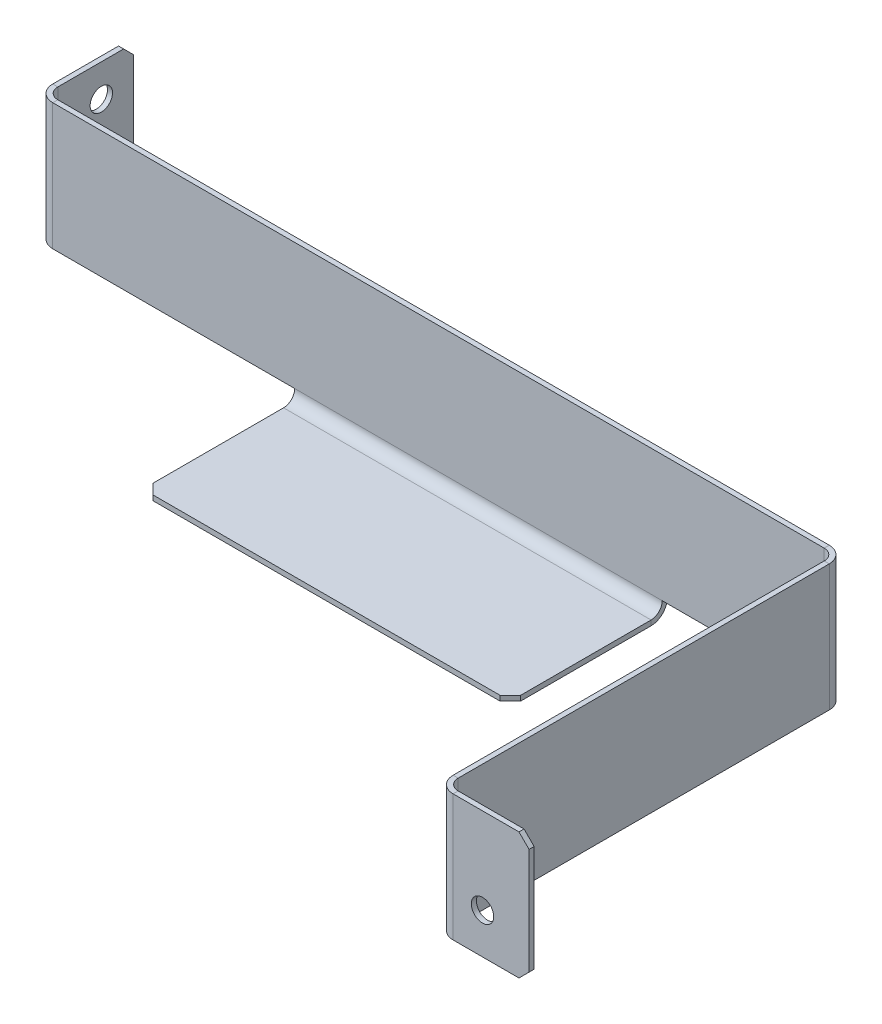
ISO-10303-21;
HEADER;
FILE_DESCRIPTION(('STEP AP214'),'2;1');
FILE_NAME('part.step','',(''),(''),'','','');
FILE_SCHEMA(('AUTOMOTIVE_DESIGN { 1 0 10303 214 1 1 1 1 }'));
ENDSEC;
DATA;
#1=APPLICATION_CONTEXT('core data for automotive mechanical design processes');
#2=APPLICATION_PROTOCOL_DEFINITION('international standard','automotive_design',2000,#1);
#3=PRODUCT_CONTEXT('',#1,'mechanical');
#4=PRODUCT('Part','Part','',(#3));
#5=PRODUCT_RELATED_PRODUCT_CATEGORY('part','',(#4));
#6=PRODUCT_DEFINITION_FORMATION('','',#4);
#7=PRODUCT_DEFINITION_CONTEXT('part definition',#1,'design');
#8=PRODUCT_DEFINITION('design','',#6,#7);
#9=PRODUCT_DEFINITION_SHAPE('','',#8);
#10=(LENGTH_UNIT() NAMED_UNIT(*) SI_UNIT(.MILLI.,.METRE.));
#11=(NAMED_UNIT(*) PLANE_ANGLE_UNIT() SI_UNIT($,.RADIAN.));
#12=(NAMED_UNIT(*) SI_UNIT($,.STERADIAN.) SOLID_ANGLE_UNIT());
#13=UNCERTAINTY_MEASURE_WITH_UNIT(LENGTH_MEASURE(1.E-05),#10,'distance_accuracy_value','');
#14=(GEOMETRIC_REPRESENTATION_CONTEXT(3) GLOBAL_UNCERTAINTY_ASSIGNED_CONTEXT((#13)) GLOBAL_UNIT_ASSIGNED_CONTEXT((#10,
#11,#12)) REPRESENTATION_CONTEXT('',''));
#15=CARTESIAN_POINT('',(0.,0.,0.));
#16=DIRECTION('',(0.,0.,1.));
#17=DIRECTION('',(1.,0.,0.));
#18=AXIS2_PLACEMENT_3D('',#15,#16,#17);
#19=CARTESIAN_POINT('',(197.612,0.,4.064));
#20=DIRECTION('',(1.,0.,0.));
#21=DIRECTION('',(0.,-1.,0.));
#22=AXIS2_PLACEMENT_3D('',#19,#20,#21);
#23=CYLINDRICAL_SURFACE('',#22,4.06400000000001);
#24=DIRECTION('',(1.,0.,0.));
#25=VECTOR('',#24,1.);
#26=CARTESIAN_POINT('',(0.,0.,0.));
#27=LINE('',#26,#25);
#28=CARTESIAN_POINT('',(64.77,0.,0.));
#29=VERTEX_POINT('',#28);
#30=CARTESIAN_POINT('',(156.972,0.,0.));
#31=VERTEX_POINT('',#30);
#32=EDGE_CURVE('E316',#29,#31,#27,.T.);
#33=ORIENTED_EDGE('',*,*,#32,.T.);
#34=CARTESIAN_POINT('',(156.972,0.,4.064));
#35=DIRECTION('',(1.,0.,0.));
#36=DIRECTION('',(0.,1.,0.));
#37=AXIS2_PLACEMENT_3D('',#34,#35,#36);
#38=CIRCLE('',#37,4.06400000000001);
#39=CARTESIAN_POINT('',(156.972,-4.064,4.06399999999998));
#40=VERTEX_POINT('',#39);
#41=EDGE_CURVE('E289',#31,#40,#38,.F.);
#42=ORIENTED_EDGE('',*,*,#41,.T.);
#43=DIRECTION('',(1.,0.,0.));
#44=VECTOR('',#43,1.);
#45=CARTESIAN_POINT('',(4.06399999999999,-4.064,4.06399999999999));
#46=LINE('',#45,#44);
#47=CARTESIAN_POINT('',(64.77,-4.064,4.06399999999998));
#48=VERTEX_POINT('',#47);
#49=EDGE_CURVE('E438',#40,#48,#46,.F.);
#50=ORIENTED_EDGE('',*,*,#49,.T.);
#51=CARTESIAN_POINT('',(64.77,0.,4.064));
#52=DIRECTION('',(-1.,0.,0.));
#53=DIRECTION('',(0.,-1.,0.));
#54=AXIS2_PLACEMENT_3D('',#51,#52,#53);
#55=CIRCLE('',#54,4.06400000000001);
#56=EDGE_CURVE('E323',#48,#29,#55,.F.);
#57=ORIENTED_EDGE('',*,*,#56,.T.);
#58=EDGE_LOOP('',(#33,#42,#50,#57));
#59=FACE_BOUND('',#58,.T.);
#60=ADVANCED_FACE('F101',(#59),#23,.T.);
#61=CARTESIAN_POINT('',(197.612,0.,4.064));
#62=DIRECTION('',(1.,0.,0.));
#63=DIRECTION('',(0.,-1.,0.));
#64=AXIS2_PLACEMENT_3D('',#61,#62,#63);
#65=CYLINDRICAL_SURFACE('',#64,2.79400000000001);
#66=CARTESIAN_POINT('',(156.972,0.,4.064));
#67=DIRECTION('',(1.,0.,0.));
#68=DIRECTION('',(0.,1.,0.));
#69=AXIS2_PLACEMENT_3D('',#66,#67,#68);
#70=CIRCLE('',#69,2.79400000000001);
#71=CARTESIAN_POINT('',(156.972,0.,1.26999999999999));
#72=VERTEX_POINT('',#71);
#73=CARTESIAN_POINT('',(156.972,-2.794,4.06399999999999));
#74=VERTEX_POINT('',#73);
#75=EDGE_CURVE('E319',#72,#74,#70,.F.);
#76=ORIENTED_EDGE('',*,*,#75,.F.);
#77=DIRECTION('',(1.,0.,0.));
#78=VECTOR('',#77,1.);
#79=CARTESIAN_POINT('',(0.,0.,1.27));
#80=LINE('',#79,#78);
#81=CARTESIAN_POINT('',(64.77,0.,1.26999999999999));
#82=VERTEX_POINT('',#81);
#83=EDGE_CURVE('E334',#82,#72,#80,.T.);
#84=ORIENTED_EDGE('',*,*,#83,.F.);
#85=CARTESIAN_POINT('',(64.77,0.,4.064));
#86=DIRECTION('',(1.,0.,0.));
#87=DIRECTION('',(0.,1.,0.));
#88=AXIS2_PLACEMENT_3D('',#85,#86,#87);
#89=CIRCLE('',#88,2.79400000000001);
#90=CARTESIAN_POINT('',(64.77,-2.794,4.06399999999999));
#91=VERTEX_POINT('',#90);
#92=EDGE_CURVE('E424',#91,#82,#89,.T.);
#93=ORIENTED_EDGE('',*,*,#92,.F.);
#94=DIRECTION('',(1.,0.,0.));
#95=VECTOR('',#94,1.);
#96=CARTESIAN_POINT('',(4.06399999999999,-2.794,4.06399999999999));
#97=LINE('',#96,#95);
#98=EDGE_CURVE('E435',#91,#74,#97,.T.);
#99=ORIENTED_EDGE('',*,*,#98,.T.);
#100=EDGE_LOOP('',(#76,#84,#93,#99));
#101=FACE_BOUND('',#100,.T.);
#102=ADVANCED_FACE('F641',(#101),#65,.F.);
#103=CARTESIAN_POINT('',(4.06399999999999,-4.06400000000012,39.37));
#104=DIRECTION('',(0.,1.,0.));
#105=DIRECTION('',(0.,0.,1.));
#106=AXIS2_PLACEMENT_3D('',#103,#104,#105);
#107=PLANE('',#106);
#108=DIRECTION('',(0.,0.,1.));
#109=VECTOR('',#108,1.);
#110=CARTESIAN_POINT('',(156.972,-4.06400000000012,39.37));
#111=LINE('',#110,#109);
#112=CARTESIAN_POINT('',(156.972,-4.06400000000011,36.83));
#113=VERTEX_POINT('',#112);
#114=EDGE_CURVE('E309',#40,#113,#111,.T.);
#115=ORIENTED_EDGE('',*,*,#114,.T.);
#116=DIRECTION('',(0.70710678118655,0.,-0.707106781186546));
#117=VECTOR('',#116,1.);
#118=CARTESIAN_POINT('',(154.432,-4.06400000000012,39.37));
#119=LINE('',#118,#117);
#120=CARTESIAN_POINT('',(154.432,-4.06400000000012,39.37));
#121=VERTEX_POINT('',#120);
#122=EDGE_CURVE('E109',#113,#121,#119,.F.);
#123=ORIENTED_EDGE('',*,*,#122,.T.);
#124=DIRECTION('',(-1.,0.,0.));
#125=VECTOR('',#124,1.);
#126=CARTESIAN_POINT('',(4.06399999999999,-4.06400000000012,39.37));
#127=LINE('',#126,#125);
#128=CARTESIAN_POINT('',(67.31,-4.06400000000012,39.37));
#129=VERTEX_POINT('',#128);
#130=EDGE_CURVE('E400',#121,#129,#127,.T.);
#131=ORIENTED_EDGE('',*,*,#130,.T.);
#132=DIRECTION('',(0.707106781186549,0.,0.707106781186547));
#133=VECTOR('',#132,1.);
#134=CARTESIAN_POINT('',(64.77,-4.06400000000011,36.83));
#135=LINE('',#134,#133);
#136=CARTESIAN_POINT('',(64.77,-4.06400000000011,36.83));
#137=VERTEX_POINT('',#136);
#138=EDGE_CURVE('E116',#129,#137,#135,.F.);
#139=ORIENTED_EDGE('',*,*,#138,.T.);
#140=DIRECTION('',(0.,0.,-1.));
#141=VECTOR('',#140,1.);
#142=CARTESIAN_POINT('',(64.77,-4.06400000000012,39.37));
#143=LINE('',#142,#141);
#144=EDGE_CURVE('E429',#137,#48,#143,.T.);
#145=ORIENTED_EDGE('',*,*,#144,.T.);
#146=ORIENTED_EDGE('',*,*,#49,.F.);
#147=EDGE_LOOP('',(#115,#123,#131,#139,#145,#146));
#148=FACE_BOUND('',#147,.T.);
#149=ADVANCED_FACE('F399',(#148),#107,.F.);
#150=CARTESIAN_POINT('',(4.06399999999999,-2.79400000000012,39.37));
#151=DIRECTION('',(0.,1.,0.));
#152=DIRECTION('',(0.,0.,1.));
#153=AXIS2_PLACEMENT_3D('',#150,#151,#152);
#154=PLANE('',#153);
#155=DIRECTION('',(1.,0.,0.));
#156=VECTOR('',#155,1.);
#157=CARTESIAN_POINT('',(4.06399999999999,-2.79400000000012,39.37));
#158=LINE('',#157,#156);
#159=CARTESIAN_POINT('',(154.432,-2.79400000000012,39.37));
#160=VERTEX_POINT('',#159);
#161=CARTESIAN_POINT('',(67.31,-2.79400000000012,39.37));
#162=VERTEX_POINT('',#161);
#163=EDGE_CURVE('E409',#160,#162,#158,.F.);
#164=ORIENTED_EDGE('',*,*,#163,.F.);
#165=DIRECTION('',(-0.70710678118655,0.,0.707106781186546));
#166=VECTOR('',#165,1.);
#167=CARTESIAN_POINT('',(79.2479999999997,-2.79400000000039,114.554));
#168=LINE('',#167,#166);
#169=CARTESIAN_POINT('',(156.972,-2.79400000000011,36.83));
#170=VERTEX_POINT('',#169);
#171=EDGE_CURVE('E394',#160,#170,#168,.F.);
#172=ORIENTED_EDGE('',*,*,#171,.T.);
#173=DIRECTION('',(0.,0.,1.));
#174=VECTOR('',#173,1.);
#175=CARTESIAN_POINT('',(156.972,-2.79400000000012,39.37));
#176=LINE('',#175,#174);
#177=EDGE_CURVE('E416',#74,#170,#176,.T.);
#178=ORIENTED_EDGE('',*,*,#177,.F.);
#179=ORIENTED_EDGE('',*,*,#98,.F.);
#180=DIRECTION('',(0.,0.,1.));
#181=VECTOR('',#180,1.);
#182=CARTESIAN_POINT('',(64.77,-2.79400000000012,39.37));
#183=LINE('',#182,#181);
#184=CARTESIAN_POINT('',(64.77,-2.79400000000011,36.83));
#185=VERTEX_POINT('',#184);
#186=EDGE_CURVE('E431',#185,#91,#183,.F.);
#187=ORIENTED_EDGE('',*,*,#186,.F.);
#188=DIRECTION('',(-0.707106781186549,0.,-0.707106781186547));
#189=VECTOR('',#188,1.);
#190=CARTESIAN_POINT('',(35.6869999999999,-2.79400000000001,7.74699999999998));
#191=LINE('',#190,#189);
#192=EDGE_CURVE('E392',#185,#162,#191,.F.);
#193=ORIENTED_EDGE('',*,*,#192,.T.);
#194=EDGE_LOOP('',(#164,#172,#178,#179,#187,#193));
#195=FACE_BOUND('',#194,.T.);
#196=ADVANCED_FACE('F414',(#195),#154,.T.);
#197=CARTESIAN_POINT('',(4.06399999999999,-4.06400000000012,39.37));
#198=DIRECTION('',(0.,0.,-1.));
#199=DIRECTION('',(0.,1.,0.));
#200=AXIS2_PLACEMENT_3D('',#197,#198,#199);
#201=PLANE('',#200);
#202=ORIENTED_EDGE('',*,*,#130,.F.);
#203=DIRECTION('',(0.,1.,0.));
#204=VECTOR('',#203,1.);
#205=CARTESIAN_POINT('',(154.432,-2.79400000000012,39.37));
#206=LINE('',#205,#204);
#207=EDGE_CURVE('E389',#121,#160,#206,.T.);
#208=ORIENTED_EDGE('',*,*,#207,.T.);
#209=ORIENTED_EDGE('',*,*,#163,.T.);
#210=DIRECTION('',(0.,-1.,0.));
#211=VECTOR('',#210,1.);
#212=CARTESIAN_POINT('',(67.31,-4.06400000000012,39.37));
#213=LINE('',#212,#211);
#214=EDGE_CURVE('E387',#162,#129,#213,.T.);
#215=ORIENTED_EDGE('',*,*,#214,.T.);
#216=EDGE_LOOP('',(#202,#208,#209,#215));
#217=FACE_BOUND('',#216,.T.);
#218=ADVANCED_FACE('F404',(#217),#201,.F.);
#219=CARTESIAN_POINT('',(201.676,31.75,101.219));
#220=DIRECTION('',(0.,-1.,0.));
#221=DIRECTION('',(0.,0.,-1.));
#222=AXIS2_PLACEMENT_3D('',#219,#220,#221);
#223=PLANE('',#222);
#224=DIRECTION('',(-1.,0.,0.));
#225=VECTOR('',#224,1.);
#226=CARTESIAN_POINT('',(201.676,31.75,97.155));
#227=LINE('',#226,#225);
#228=CARTESIAN_POINT('',(201.676,31.75,97.155));
#229=VERTEX_POINT('',#228);
#230=CARTESIAN_POINT('',(200.406,31.75,97.155));
#231=VERTEX_POINT('',#230);
#232=EDGE_CURVE('E486',#229,#231,#227,.T.);
#233=ORIENTED_EDGE('',*,*,#232,.F.);
#234=DIRECTION('',(0.,0.,1.));
#235=VECTOR('',#234,1.);
#236=CARTESIAN_POINT('',(201.676,31.75,101.219));
#237=LINE('',#236,#235);
#238=CARTESIAN_POINT('',(201.676,31.75,4.06399999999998));
#239=VERTEX_POINT('',#238);
#240=EDGE_CURVE('E506',#239,#229,#237,.T.);
#241=ORIENTED_EDGE('',*,*,#240,.F.);
#242=DIRECTION('',(1.,0.,0.));
#243=VECTOR('',#242,1.);
#244=CARTESIAN_POINT('',(200.406,31.75,4.06399999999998));
#245=LINE('',#244,#243);
#246=CARTESIAN_POINT('',(200.406,31.75,4.06399999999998));
#247=VERTEX_POINT('',#246);
#248=EDGE_CURVE('E493',#247,#239,#245,.T.);
#249=ORIENTED_EDGE('',*,*,#248,.F.);
#250=DIRECTION('',(0.,0.,1.));
#251=VECTOR('',#250,1.);
#252=CARTESIAN_POINT('',(200.406,31.75,101.219));
#253=LINE('',#252,#251);
#254=EDGE_CURVE('E501',#247,#231,#253,.T.);
#255=ORIENTED_EDGE('',*,*,#254,.T.);
#256=EDGE_LOOP('',(#233,#241,#249,#255));
#257=FACE_BOUND('',#256,.T.);
#258=ADVANCED_FACE('F699',(#257),#223,.F.);
#259=CARTESIAN_POINT('',(201.676,0.,1.27));
#260=DIRECTION('',(0.,1.,0.));
#261=DIRECTION('',(0.,0.,1.));
#262=AXIS2_PLACEMENT_3D('',#259,#260,#261);
#263=PLANE('',#262);
#264=DIRECTION('',(-1.,0.,0.));
#265=VECTOR('',#264,1.);
#266=CARTESIAN_POINT('',(201.676,0.,97.155));
#267=LINE('',#266,#265);
#268=CARTESIAN_POINT('',(201.676,0.,97.155));
#269=VERTEX_POINT('',#268);
#270=CARTESIAN_POINT('',(200.406,0.,97.155));
#271=VERTEX_POINT('',#270);
#272=EDGE_CURVE('E483',#269,#271,#267,.T.);
#273=ORIENTED_EDGE('',*,*,#272,.T.);
#274=DIRECTION('',(0.,0.,-1.));
#275=VECTOR('',#274,1.);
#276=CARTESIAN_POINT('',(200.406,0.,1.27));
#277=LINE('',#276,#275);
#278=CARTESIAN_POINT('',(200.406,0.,4.06399999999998));
#279=VERTEX_POINT('',#278);
#280=EDGE_CURVE('E504',#271,#279,#277,.T.);
#281=ORIENTED_EDGE('',*,*,#280,.T.);
#282=DIRECTION('',(1.,0.,0.));
#283=VECTOR('',#282,1.);
#284=CARTESIAN_POINT('',(200.406,0.,4.06399999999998));
#285=LINE('',#284,#283);
#286=CARTESIAN_POINT('',(201.676,0.,4.06399999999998));
#287=VERTEX_POINT('',#286);
#288=EDGE_CURVE('E489',#279,#287,#285,.T.);
#289=ORIENTED_EDGE('',*,*,#288,.T.);
#290=DIRECTION('',(0.,0.,-1.));
#291=VECTOR('',#290,1.);
#292=CARTESIAN_POINT('',(201.676,0.,1.27));
#293=LINE('',#292,#291);
#294=EDGE_CURVE('E509',#269,#287,#293,.T.);
#295=ORIENTED_EDGE('',*,*,#294,.F.);
#296=EDGE_LOOP('',(#273,#281,#289,#295));
#297=FACE_BOUND('',#296,.T.);
#298=ADVANCED_FACE('F695',(#297),#263,.F.);
#299=CARTESIAN_POINT('',(201.676,0.,1.27));
#300=DIRECTION('',(1.,0.,0.));
#301=DIRECTION('',(0.,0.,-1.));
#302=AXIS2_PLACEMENT_3D('',#299,#300,#301);
#303=PLANE('',#302);
#304=ORIENTED_EDGE('',*,*,#240,.T.);
#305=DIRECTION('',(0.,-1.,0.));
#306=VECTOR('',#305,1.);
#307=CARTESIAN_POINT('',(201.676,0.,97.155));
#308=LINE('',#307,#306);
#309=EDGE_CURVE('E473',#269,#229,#308,.F.);
#310=ORIENTED_EDGE('',*,*,#309,.F.);
#311=ORIENTED_EDGE('',*,*,#294,.T.);
#312=DIRECTION('',(0.,1.,0.));
#313=VECTOR('',#312,1.);
#314=CARTESIAN_POINT('',(201.676,0.,4.06399999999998));
#315=LINE('',#314,#313);
#316=EDGE_CURVE('E496',#287,#239,#315,.T.);
#317=ORIENTED_EDGE('',*,*,#316,.T.);
#318=EDGE_LOOP('',(#304,#310,#311,#317));
#319=FACE_BOUND('',#318,.T.);
#320=ADVANCED_FACE('F691',(#319),#303,.T.);
#321=CARTESIAN_POINT('',(200.406,0.,1.27));
#322=DIRECTION('',(1.,0.,0.));
#323=DIRECTION('',(0.,0.,-1.));
#324=AXIS2_PLACEMENT_3D('',#321,#322,#323);
#325=PLANE('',#324);
#326=DIRECTION('',(0.,-1.,0.));
#327=VECTOR('',#326,1.);
#328=CARTESIAN_POINT('',(200.406,0.,97.155));
#329=LINE('',#328,#327);
#330=EDGE_CURVE('E478',#271,#231,#329,.F.);
#331=ORIENTED_EDGE('',*,*,#330,.T.);
#332=ORIENTED_EDGE('',*,*,#254,.F.);
#333=DIRECTION('',(0.,1.,0.));
#334=VECTOR('',#333,1.);
#335=CARTESIAN_POINT('',(200.406,0.,4.06399999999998));
#336=LINE('',#335,#334);
#337=EDGE_CURVE('E491',#279,#247,#336,.T.);
#338=ORIENTED_EDGE('',*,*,#337,.F.);
#339=ORIENTED_EDGE('',*,*,#280,.F.);
#340=EDGE_LOOP('',(#331,#332,#338,#339));
#341=FACE_BOUND('',#340,.T.);
#342=ADVANCED_FACE('F688',(#341),#325,.F.);
#343=CARTESIAN_POINT('',(0.,31.75,1.27));
#344=DIRECTION('',(0.,-1.,0.));
#345=DIRECTION('',(0.,0.,-1.));
#346=AXIS2_PLACEMENT_3D('',#343,#344,#345);
#347=PLANE('',#346);
#348=DIRECTION('',(0.,0.,-1.));
#349=VECTOR('',#348,1.);
#350=CARTESIAN_POINT('',(197.612,31.75,1.27));
#351=LINE('',#350,#349);
#352=CARTESIAN_POINT('',(197.612,31.75,1.27));
#353=VERTEX_POINT('',#352);
#354=CARTESIAN_POINT('',(197.612,31.75,0.));
#355=VERTEX_POINT('',#354);
#356=EDGE_CURVE('E525',#353,#355,#351,.T.);
#357=ORIENTED_EDGE('',*,*,#356,.T.);
#358=DIRECTION('',(-1.,0.,0.));
#359=VECTOR('',#358,1.);
#360=CARTESIAN_POINT('',(0.,31.75,0.));
#361=LINE('',#360,#359);
#362=CARTESIAN_POINT('',(4.06399999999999,31.75,0.));
#363=VERTEX_POINT('',#362);
#364=EDGE_CURVE('E327',#355,#363,#361,.T.);
#365=ORIENTED_EDGE('',*,*,#364,.T.);
#366=DIRECTION('',(0.,0.,1.));
#367=VECTOR('',#366,1.);
#368=CARTESIAN_POINT('',(4.06399999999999,31.75,0.));
#369=LINE('',#368,#367);
#370=CARTESIAN_POINT('',(4.06399999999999,31.75,1.27));
#371=VERTEX_POINT('',#370);
#372=EDGE_CURVE('E329',#363,#371,#369,.T.);
#373=ORIENTED_EDGE('',*,*,#372,.T.);
#374=DIRECTION('',(-1.,0.,0.));
#375=VECTOR('',#374,1.);
#376=CARTESIAN_POINT('',(0.,31.75,1.27));
#377=LINE('',#376,#375);
#378=EDGE_CURVE('E338',#353,#371,#377,.T.);
#379=ORIENTED_EDGE('',*,*,#378,.F.);
#380=EDGE_LOOP('',(#357,#365,#373,#379));
#381=FACE_BOUND('',#380,.T.);
#382=ADVANCED_FACE('F103',(#381),#347,.F.);
#383=CARTESIAN_POINT('',(0.,31.75,1.27));
#384=DIRECTION('',(0.,0.,-1.));
#385=DIRECTION('',(-1.,0.,0.));
#386=AXIS2_PLACEMENT_3D('',#383,#384,#385);
#387=PLANE('',#386);
#388=DIRECTION('',(0.,1.,0.));
#389=VECTOR('',#388,1.);
#390=CARTESIAN_POINT('',(197.612,31.75,1.27));
#391=LINE('',#390,#389);
#392=CARTESIAN_POINT('',(197.612,0.,1.26999999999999));
#393=VERTEX_POINT('',#392);
#394=EDGE_CURVE('E516',#353,#393,#391,.F.);
#395=ORIENTED_EDGE('',*,*,#394,.F.);
#396=ORIENTED_EDGE('',*,*,#378,.T.);
#397=DIRECTION('',(0.,1.,0.));
#398=VECTOR('',#397,1.);
#399=CARTESIAN_POINT('',(4.06399999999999,31.75,1.27));
#400=LINE('',#399,#398);
#401=CARTESIAN_POINT('',(4.06399999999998,0.,1.26999999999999));
#402=VERTEX_POINT('',#401);
#403=EDGE_CURVE('E570',#371,#402,#400,.F.);
#404=ORIENTED_EDGE('',*,*,#403,.T.);
#405=EDGE_CURVE('E335',#402,#82,#80,.T.);
#406=ORIENTED_EDGE('',*,*,#405,.T.);
#407=ORIENTED_EDGE('',*,*,#83,.T.);
#408=DIRECTION('',(1.,0.,0.));
#409=VECTOR('',#408,1.);
#410=CARTESIAN_POINT('',(197.612,0.,1.26999999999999));
#411=LINE('',#410,#409);
#412=EDGE_CURVE('E308',#72,#393,#411,.T.);
#413=ORIENTED_EDGE('',*,*,#412,.T.);
#414=EDGE_LOOP('',(#395,#396,#404,#406,#407,#413));
#415=FACE_BOUND('',#414,.T.);
#416=ADVANCED_FACE('F590',(#415),#387,.F.);
#417=CARTESIAN_POINT('',(0.,31.75,0.));
#418=DIRECTION('',(0.,0.,-1.));
#419=DIRECTION('',(-1.,0.,0.));
#420=AXIS2_PLACEMENT_3D('',#417,#418,#419);
#421=PLANE('',#420);
#422=ORIENTED_EDGE('',*,*,#364,.F.);
#423=DIRECTION('',(0.,1.,0.));
#424=VECTOR('',#423,1.);
#425=CARTESIAN_POINT('',(197.612,31.75,0.));
#426=LINE('',#425,#424);
#427=CARTESIAN_POINT('',(197.612,0.,0.));
#428=VERTEX_POINT('',#427);
#429=EDGE_CURVE('E317',#355,#428,#426,.F.);
#430=ORIENTED_EDGE('',*,*,#429,.T.);
#431=DIRECTION('',(1.,0.,0.));
#432=VECTOR('',#431,1.);
#433=CARTESIAN_POINT('',(197.612,0.,0.));
#434=LINE('',#433,#432);
#435=EDGE_CURVE('E300',#31,#428,#434,.T.);
#436=ORIENTED_EDGE('',*,*,#435,.F.);
#437=ORIENTED_EDGE('',*,*,#32,.F.);
#438=CARTESIAN_POINT('',(4.06399999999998,0.,0.));
#439=VERTEX_POINT('',#438);
#440=EDGE_CURVE('E324',#439,#29,#27,.T.);
#441=ORIENTED_EDGE('',*,*,#440,.F.);
#442=DIRECTION('',(0.,1.,0.));
#443=VECTOR('',#442,1.);
#444=CARTESIAN_POINT('',(4.06399999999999,31.75,0.));
#445=LINE('',#444,#443);
#446=EDGE_CURVE('E565',#363,#439,#445,.F.);
#447=ORIENTED_EDGE('',*,*,#446,.F.);
#448=EDGE_LOOP('',(#422,#430,#436,#437,#441,#447));
#449=FACE_BOUND('',#448,.T.);
#450=ADVANCED_FACE('F314',(#449),#421,.T.);
#451=CARTESIAN_POINT('',(4.06399999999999,0.,-2.794));
#452=DIRECTION('',(0.,-1.,0.));
#453=DIRECTION('',(0.,0.,-1.));
#454=AXIS2_PLACEMENT_3D('',#451,#452,#453);
#455=PLANE('',#454);
#456=DIRECTION('',(-1.,0.,0.));
#457=VECTOR('',#456,1.);
#458=CARTESIAN_POINT('',(0.,0.,-2.79399999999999));
#459=LINE('',#458,#457);
#460=CARTESIAN_POINT('',(1.26999999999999,0.,-2.79399999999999));
#461=VERTEX_POINT('',#460);
#462=CARTESIAN_POINT('',(0.,0.,-2.79399999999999));
#463=VERTEX_POINT('',#462);
#464=EDGE_CURVE('E530',#461,#463,#459,.T.);
#465=ORIENTED_EDGE('',*,*,#464,.F.);
#466=CARTESIAN_POINT('',(4.06399999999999,0.,-2.794));
#467=DIRECTION('',(0.,1.,0.));
#468=DIRECTION('',(0.,0.,1.));
#469=AXIS2_PLACEMENT_3D('',#466,#467,#468);
#470=CIRCLE('',#469,2.794);
#471=EDGE_CURVE('E561',#439,#461,#470,.F.);
#472=ORIENTED_EDGE('',*,*,#471,.F.);
#473=DIRECTION('',(0.,0.,1.));
#474=VECTOR('',#473,1.);
#475=CARTESIAN_POINT('',(4.06399999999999,0.,0.));
#476=LINE('',#475,#474);
#477=EDGE_CURVE('E325',#439,#402,#476,.T.);
#478=ORIENTED_EDGE('',*,*,#477,.T.);
#479=CARTESIAN_POINT('',(4.06399999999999,0.,-2.794));
#480=DIRECTION('',(0.,1.,0.));
#481=DIRECTION('',(0.,0.,1.));
#482=AXIS2_PLACEMENT_3D('',#479,#480,#481);
#483=CIRCLE('',#482,4.064);
#484=EDGE_CURVE('E573',#402,#463,#483,.F.);
#485=ORIENTED_EDGE('',*,*,#484,.T.);
#486=EDGE_LOOP('',(#465,#472,#478,#485));
#487=FACE_BOUND('',#486,.T.);
#488=ADVANCED_FACE('F595',(#487),#455,.T.);
#489=CARTESIAN_POINT('',(4.06399999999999,31.75,-2.794));
#490=DIRECTION('',(0.,-1.,0.));
#491=DIRECTION('',(0.,0.,-1.));
#492=AXIS2_PLACEMENT_3D('',#489,#490,#491);
#493=PLANE('',#492);
#494=CARTESIAN_POINT('',(4.06399999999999,31.75,-2.794));
#495=DIRECTION('',(0.,1.,0.));
#496=DIRECTION('',(0.,0.,1.));
#497=AXIS2_PLACEMENT_3D('',#494,#495,#496);
#498=CIRCLE('',#497,2.794);
#499=CARTESIAN_POINT('',(1.26999999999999,31.75,-2.79399999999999));
#500=VERTEX_POINT('',#499);
#501=EDGE_CURVE('E535',#500,#363,#498,.T.);
#502=ORIENTED_EDGE('',*,*,#501,.F.);
#503=DIRECTION('',(-1.,0.,0.));
#504=VECTOR('',#503,1.);
#505=CARTESIAN_POINT('',(1.26999999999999,31.75,-2.79399999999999));
#506=LINE('',#505,#504);
#507=CARTESIAN_POINT('',(0.,31.75,-2.79399999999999));
#508=VERTEX_POINT('',#507);
#509=EDGE_CURVE('E553',#500,#508,#506,.T.);
#510=ORIENTED_EDGE('',*,*,#509,.T.);
#511=CARTESIAN_POINT('',(4.06399999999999,31.75,-2.794));
#512=DIRECTION('',(0.,1.,0.));
#513=DIRECTION('',(0.,0.,1.));
#514=AXIS2_PLACEMENT_3D('',#511,#512,#513);
#515=CIRCLE('',#514,4.064);
#516=EDGE_CURVE('E564',#508,#371,#515,.T.);
#517=ORIENTED_EDGE('',*,*,#516,.T.);
#518=ORIENTED_EDGE('',*,*,#372,.F.);
#519=EDGE_LOOP('',(#502,#510,#517,#518));
#520=FACE_BOUND('',#519,.T.);
#521=ADVANCED_FACE('F581',(#520),#493,.F.);
#522=CARTESIAN_POINT('',(4.06399999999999,31.75,-2.794));
#523=DIRECTION('',(0.,1.,0.));
#524=DIRECTION('',(-1.,0.,0.));
#525=AXIS2_PLACEMENT_3D('',#522,#523,#524);
#526=CYLINDRICAL_SURFACE('',#525,4.064);
#527=ORIENTED_EDGE('',*,*,#403,.F.);
#528=ORIENTED_EDGE('',*,*,#516,.F.);
#529=DIRECTION('',(0.,1.,0.));
#530=VECTOR('',#529,1.);
#531=CARTESIAN_POINT('',(0.,31.75,-2.79399999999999));
#532=LINE('',#531,#530);
#533=EDGE_CURVE('E550',#463,#508,#532,.T.);
#534=ORIENTED_EDGE('',*,*,#533,.F.);
#535=ORIENTED_EDGE('',*,*,#484,.F.);
#536=EDGE_LOOP('',(#527,#528,#534,#535));
#537=FACE_BOUND('',#536,.T.);
#538=ADVANCED_FACE('F586',(#537),#526,.T.);
#539=CARTESIAN_POINT('',(4.06399999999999,31.75,-2.794));
#540=DIRECTION('',(0.,1.,0.));
#541=DIRECTION('',(-1.,0.,0.));
#542=AXIS2_PLACEMENT_3D('',#539,#540,#541);
#543=CYLINDRICAL_SURFACE('',#542,2.794);
#544=ORIENTED_EDGE('',*,*,#446,.T.);
#545=ORIENTED_EDGE('',*,*,#471,.T.);
#546=DIRECTION('',(0.,-1.,0.));
#547=VECTOR('',#546,1.);
#548=CARTESIAN_POINT('',(1.26999999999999,0.,-2.79399999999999));
#549=LINE('',#548,#547);
#550=EDGE_CURVE('E556',#461,#500,#549,.F.);
#551=ORIENTED_EDGE('',*,*,#550,.T.);
#552=ORIENTED_EDGE('',*,*,#501,.T.);
#553=EDGE_LOOP('',(#544,#545,#551,#552));
#554=FACE_BOUND('',#553,.T.);
#555=ADVANCED_FACE('F601',(#554),#543,.F.);
#556=CARTESIAN_POINT('',(0.,31.75,0.));
#557=DIRECTION('',(0.,1.,0.));
#558=DIRECTION('',(0.,0.,1.));
#559=AXIS2_PLACEMENT_3D('',#556,#557,#558);
#560=PLANE('',#559);
#561=DIRECTION('',(0.,0.,-1.));
#562=VECTOR('',#561,1.);
#563=CARTESIAN_POINT('',(1.27,31.75,0.));
#564=LINE('',#563,#562);
#565=CARTESIAN_POINT('',(1.26999999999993,31.75,-19.304));
#566=VERTEX_POINT('',#565);
#567=EDGE_CURVE('E542',#566,#500,#564,.F.);
#568=ORIENTED_EDGE('',*,*,#567,.F.);
#569=DIRECTION('',(-1.,0.,0.));
#570=VECTOR('',#569,1.);
#571=CARTESIAN_POINT('',(0.,31.75,-19.304));
#572=LINE('',#571,#570);
#573=CARTESIAN_POINT('',(0.,31.75,-19.304));
#574=VERTEX_POINT('',#573);
#575=EDGE_CURVE('E360',#566,#574,#572,.T.);
#576=ORIENTED_EDGE('',*,*,#575,.T.);
#577=DIRECTION('',(0.,0.,1.));
#578=VECTOR('',#577,1.);
#579=CARTESIAN_POINT('',(0.,31.75,0.));
#580=LINE('',#579,#578);
#581=EDGE_CURVE('E533',#574,#508,#580,.T.);
#582=ORIENTED_EDGE('',*,*,#581,.T.);
#583=ORIENTED_EDGE('',*,*,#509,.F.);
#584=EDGE_LOOP('',(#568,#576,#582,#583));
#585=FACE_BOUND('',#584,.T.);
#586=ADVANCED_FACE('F605',(#585),#560,.T.);
#587=CARTESIAN_POINT('',(0.,0.,-21.844));
#588=DIRECTION('',(0.,-1.,0.));
#589=DIRECTION('',(0.,0.,-1.));
#590=AXIS2_PLACEMENT_3D('',#587,#588,#589);
#591=PLANE('',#590);
#592=DIRECTION('',(0.,0.,-1.));
#593=VECTOR('',#592,1.);
#594=CARTESIAN_POINT('',(0.,0.,-21.844));
#595=LINE('',#594,#593);
#596=CARTESIAN_POINT('',(0.,0.,-19.304));
#597=VERTEX_POINT('',#596);
#598=EDGE_CURVE('E539',#463,#597,#595,.T.);
#599=ORIENTED_EDGE('',*,*,#598,.T.);
#600=DIRECTION('',(1.,0.,0.));
#601=VECTOR('',#600,1.);
#602=CARTESIAN_POINT('',(0.,0.,-19.304));
#603=LINE('',#602,#601);
#604=CARTESIAN_POINT('',(1.26999999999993,0.,-19.304));
#605=VERTEX_POINT('',#604);
#606=EDGE_CURVE('E384',#597,#605,#603,.T.);
#607=ORIENTED_EDGE('',*,*,#606,.T.);
#608=DIRECTION('',(0.,0.,1.));
#609=VECTOR('',#608,1.);
#610=CARTESIAN_POINT('',(1.27,0.,0.));
#611=LINE('',#610,#609);
#612=EDGE_CURVE('E547',#461,#605,#611,.F.);
#613=ORIENTED_EDGE('',*,*,#612,.F.);
#614=ORIENTED_EDGE('',*,*,#464,.T.);
#615=EDGE_LOOP('',(#599,#607,#613,#614));
#616=FACE_BOUND('',#615,.T.);
#617=ADVANCED_FACE('F628',(#616),#591,.T.);
#618=CARTESIAN_POINT('',(0.,31.75,0.));
#619=DIRECTION('',(-1.,0.,0.));
#620=DIRECTION('',(0.,0.,1.));
#621=AXIS2_PLACEMENT_3D('',#618,#619,#620);
#622=PLANE('',#621);
#623=CARTESIAN_POINT('',(0.,23.622,-13.716));
#624=DIRECTION('',(-1.,0.,0.));
#625=DIRECTION('',(0.,0.,1.));
#626=AXIS2_PLACEMENT_3D('',#623,#624,#625);
#627=CIRCLE('',#626,2.8067);
#628=CARTESIAN_POINT('',(0.,23.622,-10.9093));
#629=VERTEX_POINT('',#628);
#630=EDGE_CURVE('E347',#629,#629,#627,.T.);
#631=ORIENTED_EDGE('',*,*,#630,.F.);
#632=EDGE_LOOP('',(#631));
#633=FACE_BOUND('',#632,.T.);
#634=CARTESIAN_POINT('',(0.,8.128,-10.414));
#635=DIRECTION('',(-1.,0.,0.));
#636=DIRECTION('',(0.,0.,1.));
#637=AXIS2_PLACEMENT_3D('',#634,#635,#636);
#638=CIRCLE('',#637,2.8067);
#639=CARTESIAN_POINT('',(0.,8.128,-7.60729999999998));
#640=VERTEX_POINT('',#639);
#641=EDGE_CURVE('E343',#640,#640,#638,.T.);
#642=ORIENTED_EDGE('',*,*,#641,.F.);
#643=EDGE_LOOP('',(#642));
#644=FACE_BOUND('',#643,.T.);
#645=ORIENTED_EDGE('',*,*,#581,.F.);
#646=DIRECTION('',(0.,0.707106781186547,0.707106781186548));
#647=VECTOR('',#646,1.);
#648=CARTESIAN_POINT('',(0.,41.402,-9.65199999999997));
#649=LINE('',#648,#647);
#650=CARTESIAN_POINT('',(0.,29.21,-21.844));
#651=VERTEX_POINT('',#650);
#652=EDGE_CURVE('E364',#574,#651,#649,.F.);
#653=ORIENTED_EDGE('',*,*,#652,.T.);
#654=DIRECTION('',(0.,1.,0.));
#655=VECTOR('',#654,1.);
#656=CARTESIAN_POINT('',(0.,31.75,-21.844));
#657=LINE('',#656,#655);
#658=CARTESIAN_POINT('',(0.,2.54000000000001,-21.844));
#659=VERTEX_POINT('',#658);
#660=EDGE_CURVE('E536',#659,#651,#657,.T.);
#661=ORIENTED_EDGE('',*,*,#660,.F.);
#662=DIRECTION('',(0.,0.707106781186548,-0.707106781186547));
#663=VECTOR('',#662,1.);
#664=CARTESIAN_POINT('',(0.,6.22300000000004,-25.527));
#665=LINE('',#664,#663);
#666=EDGE_CURVE('E362',#659,#597,#665,.F.);
#667=ORIENTED_EDGE('',*,*,#666,.T.);
#668=ORIENTED_EDGE('',*,*,#598,.F.);
#669=ORIENTED_EDGE('',*,*,#533,.T.);
#670=EDGE_LOOP('',(#645,#653,#661,#667,#668,#669));
#671=FACE_BOUND('',#670,.T.);
#672=ADVANCED_FACE('F610',(#633,#644,#671),#622,.T.);
#673=CARTESIAN_POINT('',(1.27,31.75,0.));
#674=DIRECTION('',(-1.,0.,0.));
#675=DIRECTION('',(0.,0.,1.));
#676=AXIS2_PLACEMENT_3D('',#673,#674,#675);
#677=PLANE('',#676);
#678=CARTESIAN_POINT('',(1.26999999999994,23.622,-13.716));
#679=DIRECTION('',(-1.,0.,0.));
#680=DIRECTION('',(0.,0.,1.));
#681=AXIS2_PLACEMENT_3D('',#678,#679,#680);
#682=CIRCLE('',#681,2.8067);
#683=CARTESIAN_POINT('',(1.26999999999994,23.622,-10.9093));
#684=VERTEX_POINT('',#683);
#685=EDGE_CURVE('E344',#684,#684,#682,.T.);
#686=ORIENTED_EDGE('',*,*,#685,.T.);
#687=EDGE_LOOP('',(#686));
#688=FACE_BOUND('',#687,.T.);
#689=CARTESIAN_POINT('',(1.26999999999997,8.128,-10.414));
#690=DIRECTION('',(-1.,0.,0.));
#691=DIRECTION('',(0.,0.,1.));
#692=AXIS2_PLACEMENT_3D('',#689,#690,#691);
#693=CIRCLE('',#692,2.8067);
#694=CARTESIAN_POINT('',(1.26999999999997,8.128,-7.60729999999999));
#695=VERTEX_POINT('',#694);
#696=EDGE_CURVE('E301',#695,#695,#693,.T.);
#697=ORIENTED_EDGE('',*,*,#696,.T.);
#698=EDGE_LOOP('',(#697));
#699=FACE_BOUND('',#698,.T.);
#700=DIRECTION('',(0.,-1.,0.));
#701=VECTOR('',#700,1.);
#702=CARTESIAN_POINT('',(1.26999999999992,31.75,-21.844));
#703=LINE('',#702,#701);
#704=CARTESIAN_POINT('',(1.26999999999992,2.54000000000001,-21.844));
#705=VERTEX_POINT('',#704);
#706=CARTESIAN_POINT('',(1.26999999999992,29.21,-21.844));
#707=VERTEX_POINT('',#706);
#708=EDGE_CURVE('E544',#705,#707,#703,.F.);
#709=ORIENTED_EDGE('',*,*,#708,.T.);
#710=DIRECTION('',(0.,-0.707106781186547,-0.707106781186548));
#711=VECTOR('',#710,1.);
#712=CARTESIAN_POINT('',(1.26999999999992,29.21,-21.844));
#713=LINE('',#712,#711);
#714=EDGE_CURVE('E358',#707,#566,#713,.F.);
#715=ORIENTED_EDGE('',*,*,#714,.T.);
#716=ORIENTED_EDGE('',*,*,#567,.T.);
#717=ORIENTED_EDGE('',*,*,#550,.F.);
#718=ORIENTED_EDGE('',*,*,#612,.T.);
#719=DIRECTION('',(0.,-0.707106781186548,0.707106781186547));
#720=VECTOR('',#719,1.);
#721=CARTESIAN_POINT('',(1.26999999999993,0.,-19.304));
#722=LINE('',#721,#720);
#723=EDGE_CURVE('E356',#605,#705,#722,.F.);
#724=ORIENTED_EDGE('',*,*,#723,.T.);
#725=EDGE_LOOP('',(#709,#715,#716,#717,#718,#724));
#726=FACE_BOUND('',#725,.T.);
#727=ADVANCED_FACE('F621',(#688,#699,#726),#677,.F.);
#728=CARTESIAN_POINT('',(0.,31.75,-21.844));
#729=DIRECTION('',(0.,0.,-1.));
#730=DIRECTION('',(-1.,0.,0.));
#731=AXIS2_PLACEMENT_3D('',#728,#729,#730);
#732=PLANE('',#731);
#733=ORIENTED_EDGE('',*,*,#660,.T.);
#734=DIRECTION('',(1.,0.,0.));
#735=VECTOR('',#734,1.);
#736=CARTESIAN_POINT('',(0.,29.21,-21.844));
#737=LINE('',#736,#735);
#738=EDGE_CURVE('E353',#651,#707,#737,.T.);
#739=ORIENTED_EDGE('',*,*,#738,.T.);
#740=ORIENTED_EDGE('',*,*,#708,.F.);
#741=DIRECTION('',(-1.,0.,0.));
#742=VECTOR('',#741,1.);
#743=CARTESIAN_POINT('',(0.,2.54000000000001,-21.844));
#744=LINE('',#743,#742);
#745=EDGE_CURVE('E340',#705,#659,#744,.T.);
#746=ORIENTED_EDGE('',*,*,#745,.T.);
#747=EDGE_LOOP('',(#733,#739,#740,#746));
#748=FACE_BOUND('',#747,.T.);
#749=ADVANCED_FACE('F618',(#748),#732,.T.);
#750=CARTESIAN_POINT('',(197.612,0.,4.06399999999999));
#751=DIRECTION('',(0.,-1.,0.));
#752=DIRECTION('',(0.,0.,-1.));
#753=AXIS2_PLACEMENT_3D('',#750,#751,#752);
#754=PLANE('',#753);
#755=ORIENTED_EDGE('',*,*,#288,.F.);
#756=CARTESIAN_POINT('',(197.612,0.,4.06399999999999));
#757=DIRECTION('',(0.,1.,0.));
#758=DIRECTION('',(0.,0.,1.));
#759=AXIS2_PLACEMENT_3D('',#756,#757,#758);
#760=CIRCLE('',#759,2.79399999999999);
#761=EDGE_CURVE('E512',#393,#279,#760,.F.);
#762=ORIENTED_EDGE('',*,*,#761,.F.);
#763=DIRECTION('',(0.,0.,-1.));
#764=VECTOR('',#763,1.);
#765=CARTESIAN_POINT('',(197.612,0.,1.27));
#766=LINE('',#765,#764);
#767=EDGE_CURVE('E528',#393,#428,#766,.T.);
#768=ORIENTED_EDGE('',*,*,#767,.T.);
#769=CARTESIAN_POINT('',(197.612,0.,4.06399999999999));
#770=DIRECTION('',(0.,1.,0.));
#771=DIRECTION('',(0.,0.,1.));
#772=AXIS2_PLACEMENT_3D('',#769,#770,#771);
#773=CIRCLE('',#772,4.06399999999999);
#774=EDGE_CURVE('E522',#428,#287,#773,.F.);
#775=ORIENTED_EDGE('',*,*,#774,.T.);
#776=EDGE_LOOP('',(#755,#762,#768,#775));
#777=FACE_BOUND('',#776,.T.);
#778=ADVANCED_FACE('F712',(#777),#754,.T.);
#779=CARTESIAN_POINT('',(197.612,31.75,4.06399999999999));
#780=DIRECTION('',(0.,-1.,0.));
#781=DIRECTION('',(0.,0.,-1.));
#782=AXIS2_PLACEMENT_3D('',#779,#780,#781);
#783=PLANE('',#782);
#784=CARTESIAN_POINT('',(197.612,31.75,4.06399999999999));
#785=DIRECTION('',(0.,1.,0.));
#786=DIRECTION('',(0.,0.,1.));
#787=AXIS2_PLACEMENT_3D('',#784,#785,#786);
#788=CIRCLE('',#787,2.79399999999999);
#789=EDGE_CURVE('E511',#247,#353,#788,.T.);
#790=ORIENTED_EDGE('',*,*,#789,.F.);
#791=ORIENTED_EDGE('',*,*,#248,.T.);
#792=CARTESIAN_POINT('',(197.612,31.75,4.06399999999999));
#793=DIRECTION('',(0.,1.,0.));
#794=DIRECTION('',(0.,0.,1.));
#795=AXIS2_PLACEMENT_3D('',#792,#793,#794);
#796=CIRCLE('',#795,4.06399999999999);
#797=EDGE_CURVE('E515',#239,#355,#796,.T.);
#798=ORIENTED_EDGE('',*,*,#797,.T.);
#799=ORIENTED_EDGE('',*,*,#356,.F.);
#800=EDGE_LOOP('',(#790,#791,#798,#799));
#801=FACE_BOUND('',#800,.T.);
#802=ADVANCED_FACE('F708',(#801),#783,.F.);
#803=CARTESIAN_POINT('',(197.612,31.75,4.06399999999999));
#804=DIRECTION('',(0.,1.,0.));
#805=DIRECTION('',(1.,0.,0.));
#806=AXIS2_PLACEMENT_3D('',#803,#804,#805);
#807=CYLINDRICAL_SURFACE('',#806,4.06399999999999);
#808=ORIENTED_EDGE('',*,*,#429,.F.);
#809=ORIENTED_EDGE('',*,*,#797,.F.);
#810=ORIENTED_EDGE('',*,*,#316,.F.);
#811=ORIENTED_EDGE('',*,*,#774,.F.);
#812=EDGE_LOOP('',(#808,#809,#810,#811));
#813=FACE_BOUND('',#812,.T.);
#814=ADVANCED_FACE('F706',(#813),#807,.T.);
#815=CARTESIAN_POINT('',(197.612,31.75,4.06399999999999));
#816=DIRECTION('',(0.,1.,0.));
#817=DIRECTION('',(1.,0.,0.));
#818=AXIS2_PLACEMENT_3D('',#815,#816,#817);
#819=CYLINDRICAL_SURFACE('',#818,2.79399999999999);
#820=ORIENTED_EDGE('',*,*,#394,.T.);
#821=ORIENTED_EDGE('',*,*,#761,.T.);
#822=ORIENTED_EDGE('',*,*,#337,.T.);
#823=ORIENTED_EDGE('',*,*,#789,.T.);
#824=EDGE_LOOP('',(#820,#821,#822,#823));
#825=FACE_BOUND('',#824,.T.);
#826=ADVANCED_FACE('F683',(#825),#819,.F.);
#827=CARTESIAN_POINT('',(204.47,31.75,97.155));
#828=DIRECTION('',(0.,1.,0.));
#829=DIRECTION('',(0.,0.,1.));
#830=AXIS2_PLACEMENT_3D('',#827,#828,#829);
#831=PLANE('',#830);
#832=DIRECTION('',(0.,0.,1.));
#833=VECTOR('',#832,1.);
#834=CARTESIAN_POINT('',(204.47,31.75,101.219));
#835=LINE('',#834,#833);
#836=CARTESIAN_POINT('',(204.47,31.75,99.949));
#837=VERTEX_POINT('',#836);
#838=CARTESIAN_POINT('',(204.47,31.75,101.219));
#839=VERTEX_POINT('',#838);
#840=EDGE_CURVE('E408',#837,#839,#835,.T.);
#841=ORIENTED_EDGE('',*,*,#840,.F.);
#842=CARTESIAN_POINT('',(204.47,31.75,97.155));
#843=DIRECTION('',(0.,-1.,0.));
#844=DIRECTION('',(0.,0.,-1.));
#845=AXIS2_PLACEMENT_3D('',#842,#843,#844);
#846=CIRCLE('',#845,2.794);
#847=EDGE_CURVE('E469',#229,#837,#846,.F.);
#848=ORIENTED_EDGE('',*,*,#847,.F.);
#849=ORIENTED_EDGE('',*,*,#232,.T.);
#850=CARTESIAN_POINT('',(204.47,31.75,97.155));
#851=DIRECTION('',(0.,-1.,0.));
#852=DIRECTION('',(0.,0.,-1.));
#853=AXIS2_PLACEMENT_3D('',#850,#851,#852);
#854=CIRCLE('',#853,4.06400000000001);
#855=EDGE_CURVE('E480',#231,#839,#854,.F.);
#856=ORIENTED_EDGE('',*,*,#855,.T.);
#857=EDGE_LOOP('',(#841,#848,#849,#856));
#858=FACE_BOUND('',#857,.T.);
#859=ADVANCED_FACE('F680',(#858),#831,.T.);
#860=CARTESIAN_POINT('',(204.47,0.,97.155));
#861=DIRECTION('',(0.,1.,0.));
#862=DIRECTION('',(0.,0.,1.));
#863=AXIS2_PLACEMENT_3D('',#860,#861,#862);
#864=PLANE('',#863);
#865=CARTESIAN_POINT('',(204.47,0.,97.155));
#866=DIRECTION('',(0.,-1.,0.));
#867=DIRECTION('',(0.,0.,-1.));
#868=AXIS2_PLACEMENT_3D('',#865,#866,#867);
#869=CIRCLE('',#868,2.794);
#870=CARTESIAN_POINT('',(204.47,0.,99.949));
#871=VERTEX_POINT('',#870);
#872=EDGE_CURVE('E443',#871,#269,#869,.T.);
#873=ORIENTED_EDGE('',*,*,#872,.F.);
#874=DIRECTION('',(0.,0.,1.));
#875=VECTOR('',#874,1.);
#876=CARTESIAN_POINT('',(204.47,0.,99.949));
#877=LINE('',#876,#875);
#878=CARTESIAN_POINT('',(204.47,0.,101.219));
#879=VERTEX_POINT('',#878);
#880=EDGE_CURVE('E461',#871,#879,#877,.T.);
#881=ORIENTED_EDGE('',*,*,#880,.T.);
#882=CARTESIAN_POINT('',(204.47,0.,97.155));
#883=DIRECTION('',(0.,-1.,0.));
#884=DIRECTION('',(0.,0.,-1.));
#885=AXIS2_PLACEMENT_3D('',#882,#883,#884);
#886=CIRCLE('',#885,4.06400000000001);
#887=EDGE_CURVE('E472',#879,#271,#886,.T.);
#888=ORIENTED_EDGE('',*,*,#887,.T.);
#889=ORIENTED_EDGE('',*,*,#272,.F.);
#890=EDGE_LOOP('',(#873,#881,#888,#889));
#891=FACE_BOUND('',#890,.T.);
#892=ADVANCED_FACE('F676',(#891),#864,.F.);
#893=CARTESIAN_POINT('',(204.47,0.,97.155));
#894=DIRECTION('',(0.,-1.,0.));
#895=DIRECTION('',(0.,0.,1.));
#896=AXIS2_PLACEMENT_3D('',#893,#894,#895);
#897=CYLINDRICAL_SURFACE('',#896,4.06400000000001);
#898=ORIENTED_EDGE('',*,*,#330,.F.);
#899=ORIENTED_EDGE('',*,*,#887,.F.);
#900=DIRECTION('',(0.,-1.,0.));
#901=VECTOR('',#900,1.);
#902=CARTESIAN_POINT('',(204.47,0.,101.219));
#903=LINE('',#902,#901);
#904=EDGE_CURVE('E458',#839,#879,#903,.T.);
#905=ORIENTED_EDGE('',*,*,#904,.F.);
#906=ORIENTED_EDGE('',*,*,#855,.F.);
#907=EDGE_LOOP('',(#898,#899,#905,#906));
#908=FACE_BOUND('',#907,.T.);
#909=ADVANCED_FACE('F674',(#908),#897,.T.);
#910=CARTESIAN_POINT('',(204.47,0.,97.155));
#911=DIRECTION('',(0.,-1.,0.));
#912=DIRECTION('',(0.,0.,1.));
#913=AXIS2_PLACEMENT_3D('',#910,#911,#912);
#914=CYLINDRICAL_SURFACE('',#913,2.794);
#915=ORIENTED_EDGE('',*,*,#309,.T.);
#916=ORIENTED_EDGE('',*,*,#847,.T.);
#917=DIRECTION('',(0.,1.,0.));
#918=VECTOR('',#917,1.);
#919=CARTESIAN_POINT('',(204.47,31.75,99.949));
#920=LINE('',#919,#918);
#921=EDGE_CURVE('E464',#837,#871,#920,.F.);
#922=ORIENTED_EDGE('',*,*,#921,.T.);
#923=ORIENTED_EDGE('',*,*,#872,.T.);
#924=EDGE_LOOP('',(#915,#916,#922,#923));
#925=FACE_BOUND('',#924,.T.);
#926=ADVANCED_FACE('F664',(#925),#914,.F.);
#927=CARTESIAN_POINT('',(201.676,0.,101.219));
#928=DIRECTION('',(0.,-1.,0.));
#929=DIRECTION('',(0.,0.,-1.));
#930=AXIS2_PLACEMENT_3D('',#927,#928,#929);
#931=PLANE('',#930);
#932=DIRECTION('',(1.,0.,0.));
#933=VECTOR('',#932,1.);
#934=CARTESIAN_POINT('',(201.676,0.,99.949));
#935=LINE('',#934,#933);
#936=CARTESIAN_POINT('',(220.98,0.,99.949));
#937=VERTEX_POINT('',#936);
#938=EDGE_CURVE('E450',#937,#871,#935,.F.);
#939=ORIENTED_EDGE('',*,*,#938,.F.);
#940=DIRECTION('',(0.,0.,1.));
#941=VECTOR('',#940,1.);
#942=CARTESIAN_POINT('',(220.98,0.,101.219));
#943=LINE('',#942,#941);
#944=CARTESIAN_POINT('',(220.98,0.,101.219));
#945=VERTEX_POINT('',#944);
#946=EDGE_CURVE('E382',#937,#945,#943,.T.);
#947=ORIENTED_EDGE('',*,*,#946,.T.);
#948=DIRECTION('',(-1.,0.,0.));
#949=VECTOR('',#948,1.);
#950=CARTESIAN_POINT('',(201.676,0.,101.219));
#951=LINE('',#950,#949);
#952=EDGE_CURVE('E441',#945,#879,#951,.T.);
#953=ORIENTED_EDGE('',*,*,#952,.T.);
#954=ORIENTED_EDGE('',*,*,#880,.F.);
#955=EDGE_LOOP('',(#939,#947,#953,#954));
#956=FACE_BOUND('',#955,.T.);
#957=ADVANCED_FACE('F661',(#956),#931,.T.);
#958=CARTESIAN_POINT('',(223.52,31.75,101.219));
#959=DIRECTION('',(0.,1.,0.));
#960=DIRECTION('',(-1.,0.,0.));
#961=AXIS2_PLACEMENT_3D('',#958,#959,#960);
#962=PLANE('',#961);
#963=DIRECTION('',(1.,0.,0.));
#964=VECTOR('',#963,1.);
#965=CARTESIAN_POINT('',(223.52,31.75,101.219));
#966=LINE('',#965,#964);
#967=CARTESIAN_POINT('',(220.98,31.75,101.219));
#968=VERTEX_POINT('',#967);
#969=EDGE_CURVE('E447',#839,#968,#966,.T.);
#970=ORIENTED_EDGE('',*,*,#969,.T.);
#971=DIRECTION('',(0.,0.,-1.));
#972=VECTOR('',#971,1.);
#973=CARTESIAN_POINT('',(220.98,31.75,101.219));
#974=LINE('',#973,#972);
#975=CARTESIAN_POINT('',(220.98,31.75,99.949));
#976=VERTEX_POINT('',#975);
#977=EDGE_CURVE('E366',#968,#976,#974,.T.);
#978=ORIENTED_EDGE('',*,*,#977,.T.);
#979=DIRECTION('',(-1.,0.,0.));
#980=VECTOR('',#979,1.);
#981=CARTESIAN_POINT('',(201.676,31.75,99.949));
#982=LINE('',#981,#980);
#983=EDGE_CURVE('E455',#837,#976,#982,.F.);
#984=ORIENTED_EDGE('',*,*,#983,.F.);
#985=ORIENTED_EDGE('',*,*,#840,.T.);
#986=EDGE_LOOP('',(#970,#978,#984,#985));
#987=FACE_BOUND('',#986,.T.);
#988=ADVANCED_FACE('F659',(#987),#962,.T.);
#989=CARTESIAN_POINT('',(201.676,0.,101.219));
#990=DIRECTION('',(0.,0.,1.));
#991=DIRECTION('',(1.,0.,0.));
#992=AXIS2_PLACEMENT_3D('',#989,#990,#991);
#993=PLANE('',#992);
#994=CARTESIAN_POINT('',(211.836,10.16,101.219));
#995=DIRECTION('',(0.,0.,1.));
#996=DIRECTION('',(1.,0.,0.));
#997=AXIS2_PLACEMENT_3D('',#994,#995,#996);
#998=CIRCLE('',#997,2.80669999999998);
#999=CARTESIAN_POINT('',(214.6427,10.16,101.219));
#1000=VERTEX_POINT('',#999);
#1001=EDGE_CURVE('E351',#1000,#1000,#998,.T.);
#1002=ORIENTED_EDGE('',*,*,#1001,.F.);
#1003=EDGE_LOOP('',(#1002));
#1004=FACE_BOUND('',#1003,.T.);
#1005=DIRECTION('',(0.,-1.,0.));
#1006=VECTOR('',#1005,1.);
#1007=CARTESIAN_POINT('',(223.52,0.,101.219));
#1008=LINE('',#1007,#1006);
#1009=CARTESIAN_POINT('',(223.52,29.21,101.219));
#1010=VERTEX_POINT('',#1009);
#1011=CARTESIAN_POINT('',(223.52,2.53999999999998,101.219));
#1012=VERTEX_POINT('',#1011);
#1013=EDGE_CURVE('E444',#1010,#1012,#1008,.T.);
#1014=ORIENTED_EDGE('',*,*,#1013,.F.);
#1015=DIRECTION('',(0.70710678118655,-0.707106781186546,0.));
#1016=VECTOR('',#1015,1.);
#1017=CARTESIAN_POINT('',(227.203,25.5270000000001,101.219));
#1018=LINE('',#1017,#1016);
#1019=EDGE_CURVE('E380',#1010,#968,#1018,.F.);
#1020=ORIENTED_EDGE('',*,*,#1019,.T.);
#1021=ORIENTED_EDGE('',*,*,#969,.F.);
#1022=ORIENTED_EDGE('',*,*,#904,.T.);
#1023=ORIENTED_EDGE('',*,*,#952,.F.);
#1024=DIRECTION('',(-0.707106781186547,-0.707106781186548,0.));
#1025=VECTOR('',#1024,1.);
#1026=CARTESIAN_POINT('',(211.328,-9.65200000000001,101.219));
#1027=LINE('',#1026,#1025);
#1028=EDGE_CURVE('E378',#945,#1012,#1027,.F.);
#1029=ORIENTED_EDGE('',*,*,#1028,.T.);
#1030=EDGE_LOOP('',(#1014,#1020,#1021,#1022,#1023,#1029));
#1031=FACE_BOUND('',#1030,.T.);
#1032=ADVANCED_FACE('F655',(#1004,#1031),#993,.T.);
#1033=CARTESIAN_POINT('',(201.676,0.,99.949));
#1034=DIRECTION('',(0.,0.,1.));
#1035=DIRECTION('',(1.,0.,0.));
#1036=AXIS2_PLACEMENT_3D('',#1033,#1034,#1035);
#1037=PLANE('',#1036);
#1038=CARTESIAN_POINT('',(211.836,10.16,99.949));
#1039=DIRECTION('',(0.,0.,1.));
#1040=DIRECTION('',(1.,0.,0.));
#1041=AXIS2_PLACEMENT_3D('',#1038,#1039,#1040);
#1042=CIRCLE('',#1041,2.80669999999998);
#1043=CARTESIAN_POINT('',(214.6427,10.16,99.949));
#1044=VERTEX_POINT('',#1043);
#1045=EDGE_CURVE('E348',#1044,#1044,#1042,.T.);
#1046=ORIENTED_EDGE('',*,*,#1045,.T.);
#1047=EDGE_LOOP('',(#1046));
#1048=FACE_BOUND('',#1047,.T.);
#1049=ORIENTED_EDGE('',*,*,#983,.T.);
#1050=DIRECTION('',(-0.70710678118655,0.707106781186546,0.));
#1051=VECTOR('',#1050,1.);
#1052=CARTESIAN_POINT('',(220.98,31.75,99.949));
#1053=LINE('',#1052,#1051);
#1054=CARTESIAN_POINT('',(223.52,29.21,99.949));
#1055=VERTEX_POINT('',#1054);
#1056=EDGE_CURVE('E371',#976,#1055,#1053,.F.);
#1057=ORIENTED_EDGE('',*,*,#1056,.T.);
#1058=DIRECTION('',(0.,1.,0.));
#1059=VECTOR('',#1058,1.);
#1060=CARTESIAN_POINT('',(223.52,0.,99.949));
#1061=LINE('',#1060,#1059);
#1062=CARTESIAN_POINT('',(223.52,2.53999999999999,99.949));
#1063=VERTEX_POINT('',#1062);
#1064=EDGE_CURVE('E452',#1055,#1063,#1061,.F.);
#1065=ORIENTED_EDGE('',*,*,#1064,.T.);
#1066=DIRECTION('',(0.707106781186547,0.707106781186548,0.));
#1067=VECTOR('',#1066,1.);
#1068=CARTESIAN_POINT('',(223.52,2.53999999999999,99.949));
#1069=LINE('',#1068,#1067);
#1070=EDGE_CURVE('E369',#1063,#937,#1069,.F.);
#1071=ORIENTED_EDGE('',*,*,#1070,.T.);
#1072=ORIENTED_EDGE('',*,*,#938,.T.);
#1073=ORIENTED_EDGE('',*,*,#921,.F.);
#1074=EDGE_LOOP('',(#1049,#1057,#1065,#1071,#1072,#1073));
#1075=FACE_BOUND('',#1074,.T.);
#1076=ADVANCED_FACE('F651',(#1048,#1075),#1037,.F.);
#1077=CARTESIAN_POINT('',(223.52,0.,101.219));
#1078=DIRECTION('',(1.,0.,0.));
#1079=DIRECTION('',(0.,0.,-1.));
#1080=AXIS2_PLACEMENT_3D('',#1077,#1078,#1079);
#1081=PLANE('',#1080);
#1082=ORIENTED_EDGE('',*,*,#1064,.F.);
#1083=DIRECTION('',(0.,0.,1.));
#1084=VECTOR('',#1083,1.);
#1085=CARTESIAN_POINT('',(223.52,29.21,101.219));
#1086=LINE('',#1085,#1084);
#1087=EDGE_CURVE('E376',#1055,#1010,#1086,.T.);
#1088=ORIENTED_EDGE('',*,*,#1087,.T.);
#1089=ORIENTED_EDGE('',*,*,#1013,.T.);
#1090=DIRECTION('',(0.,0.,-1.));
#1091=VECTOR('',#1090,1.);
#1092=CARTESIAN_POINT('',(223.52,2.53999999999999,101.219));
#1093=LINE('',#1092,#1091);
#1094=EDGE_CURVE('E373',#1012,#1063,#1093,.T.);
#1095=ORIENTED_EDGE('',*,*,#1094,.T.);
#1096=EDGE_LOOP('',(#1082,#1088,#1089,#1095));
#1097=FACE_BOUND('',#1096,.T.);
#1098=ADVANCED_FACE('F654',(#1097),#1081,.T.);
#1099=CARTESIAN_POINT('',(64.77,-4.06400000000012,39.37));
#1100=DIRECTION('',(1.,0.,0.));
#1101=DIRECTION('',(0.,0.,-1.));
#1102=AXIS2_PLACEMENT_3D('',#1099,#1100,#1101);
#1103=PLANE('',#1102);
#1104=ORIENTED_EDGE('',*,*,#144,.F.);
#1105=DIRECTION('',(0.,-1.,0.));
#1106=VECTOR('',#1105,1.);
#1107=CARTESIAN_POINT('',(64.77,-2.79400000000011,36.83));
#1108=LINE('',#1107,#1106);
#1109=EDGE_CURVE('E14',#137,#185,#1108,.F.);
#1110=ORIENTED_EDGE('',*,*,#1109,.T.);
#1111=ORIENTED_EDGE('',*,*,#186,.T.);
#1112=DIRECTION('',(0.,-1.,0.));
#1113=VECTOR('',#1112,1.);
#1114=CARTESIAN_POINT('',(64.77,-4.064,4.06399999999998));
#1115=LINE('',#1114,#1113);
#1116=EDGE_CURVE('E433',#48,#91,#1115,.F.);
#1117=ORIENTED_EDGE('',*,*,#1116,.F.);
#1118=EDGE_LOOP('',(#1104,#1110,#1111,#1117));
#1119=FACE_BOUND('',#1118,.T.);
#1120=ADVANCED_FACE('F668',(#1119),#1103,.F.);
#1121=CARTESIAN_POINT('',(34.417,0.,0.));
#1122=DIRECTION('',(0.,1.,0.));
#1123=DIRECTION('',(1.,0.,0.));
#1124=AXIS2_PLACEMENT_3D('',#1121,#1122,#1123);
#1125=PLANE('',#1124);
#1126=ORIENTED_EDGE('',*,*,#477,.F.);
#1127=ORIENTED_EDGE('',*,*,#440,.T.);
#1128=DIRECTION('',(0.,0.,-1.));
#1129=VECTOR('',#1128,1.);
#1130=CARTESIAN_POINT('',(64.77,0.,0.));
#1131=LINE('',#1130,#1129);
#1132=EDGE_CURVE('E426',#29,#82,#1131,.F.);
#1133=ORIENTED_EDGE('',*,*,#1132,.T.);
#1134=ORIENTED_EDGE('',*,*,#405,.F.);
#1135=EDGE_LOOP('',(#1126,#1127,#1133,#1134));
#1136=FACE_BOUND('',#1135,.T.);
#1137=ADVANCED_FACE('F597',(#1136),#1125,.F.);
#1138=CARTESIAN_POINT('',(64.77,0.,4.064));
#1139=DIRECTION('',(1.,0.,0.));
#1140=DIRECTION('',(0.,1.,0.));
#1141=AXIS2_PLACEMENT_3D('',#1138,#1139,#1140);
#1142=PLANE('',#1141);
#1143=ORIENTED_EDGE('',*,*,#1132,.F.);
#1144=ORIENTED_EDGE('',*,*,#56,.F.);
#1145=ORIENTED_EDGE('',*,*,#1116,.T.);
#1146=ORIENTED_EDGE('',*,*,#92,.T.);
#1147=EDGE_LOOP('',(#1143,#1144,#1145,#1146));
#1148=FACE_BOUND('',#1147,.T.);
#1149=ADVANCED_FACE('F770',(#1148),#1142,.F.);
#1150=CARTESIAN_POINT('',(156.972,-4.06400000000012,39.37));
#1151=DIRECTION('',(-1.,0.,0.));
#1152=DIRECTION('',(0.,0.,1.));
#1153=AXIS2_PLACEMENT_3D('',#1150,#1151,#1152);
#1154=PLANE('',#1153);
#1155=ORIENTED_EDGE('',*,*,#177,.T.);
#1156=DIRECTION('',(0.,1.,0.));
#1157=VECTOR('',#1156,1.);
#1158=CARTESIAN_POINT('',(156.972,-4.06400000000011,36.83));
#1159=LINE('',#1158,#1157);
#1160=EDGE_CURVE('E124',#170,#113,#1159,.F.);
#1161=ORIENTED_EDGE('',*,*,#1160,.T.);
#1162=ORIENTED_EDGE('',*,*,#114,.F.);
#1163=DIRECTION('',(0.,-1.,0.));
#1164=VECTOR('',#1163,1.);
#1165=CARTESIAN_POINT('',(156.972,-4.064,4.06399999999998));
#1166=LINE('',#1165,#1164);
#1167=EDGE_CURVE('E295',#40,#74,#1166,.F.);
#1168=ORIENTED_EDGE('',*,*,#1167,.T.);
#1169=EDGE_LOOP('',(#1155,#1161,#1162,#1168));
#1170=FACE_BOUND('',#1169,.T.);
#1171=ADVANCED_FACE('F418',(#1170),#1154,.F.);
#1172=CARTESIAN_POINT('',(156.972,0.,4.064));
#1173=DIRECTION('',(-1.,0.,0.));
#1174=DIRECTION('',(0.,-1.,0.));
#1175=AXIS2_PLACEMENT_3D('',#1172,#1173,#1174);
#1176=PLANE('',#1175);
#1177=ORIENTED_EDGE('',*,*,#1167,.F.);
#1178=ORIENTED_EDGE('',*,*,#41,.F.);
#1179=DIRECTION('',(0.,0.,-1.));
#1180=VECTOR('',#1179,1.);
#1181=CARTESIAN_POINT('',(156.972,0.,0.));
#1182=LINE('',#1181,#1180);
#1183=EDGE_CURVE('E292',#31,#72,#1182,.F.);
#1184=ORIENTED_EDGE('',*,*,#1183,.T.);
#1185=ORIENTED_EDGE('',*,*,#75,.T.);
#1186=EDGE_LOOP('',(#1177,#1178,#1184,#1185));
#1187=FACE_BOUND('',#1186,.T.);
#1188=ADVANCED_FACE('F291',(#1187),#1176,.F.);
#1189=CARTESIAN_POINT('',(177.292,0.,0.));
#1190=DIRECTION('',(0.,1.,0.));
#1191=DIRECTION('',(1.,0.,0.));
#1192=AXIS2_PLACEMENT_3D('',#1189,#1190,#1191);
#1193=PLANE('',#1192);
#1194=ORIENTED_EDGE('',*,*,#435,.T.);
#1195=ORIENTED_EDGE('',*,*,#767,.F.);
#1196=ORIENTED_EDGE('',*,*,#412,.F.);
#1197=ORIENTED_EDGE('',*,*,#1183,.F.);
#1198=EDGE_LOOP('',(#1194,#1195,#1196,#1197));
#1199=FACE_BOUND('',#1198,.T.);
#1200=ADVANCED_FACE('F305',(#1199),#1193,.F.);
#1201=CARTESIAN_POINT('',(223.52,8.128,-10.4140000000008));
#1202=DIRECTION('',(-1.,0.,0.));
#1203=DIRECTION('',(0.,0.,1.));
#1204=AXIS2_PLACEMENT_3D('',#1201,#1202,#1203);
#1205=CYLINDRICAL_SURFACE('',#1204,2.8067);
#1206=CARTESIAN_POINT('',(0.,8.128,-7.60729999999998));
#1207=CARTESIAN_POINT('',(0.0132291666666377,8.128,-7.60729999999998));
#1208=CARTESIAN_POINT('',(0.0264583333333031,8.128,-7.60729999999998));
#1209=CARTESIAN_POINT('',(0.052916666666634,8.128,-7.60729999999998));
#1210=CARTESIAN_POINT('',(0.0661458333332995,8.128,-7.60729999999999));
#1211=CARTESIAN_POINT('',(0.0926041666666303,8.128,-7.60729999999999));
#1212=CARTESIAN_POINT('',(0.105833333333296,8.128,-7.60729999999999));
#1213=CARTESIAN_POINT('',(0.132291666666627,8.128,-7.60729999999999));
#1214=CARTESIAN_POINT('',(0.145520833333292,8.128,-7.60729999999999));
#1215=CARTESIAN_POINT('',(0.171979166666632,8.128,-7.60729999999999));
#1216=CARTESIAN_POINT('',(0.185208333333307,8.128,-7.60729999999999));
#1217=CARTESIAN_POINT('',(0.211666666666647,8.128,-7.60729999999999));
#1218=CARTESIAN_POINT('',(0.224895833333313,8.128,-7.60729999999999));
#1219=CARTESIAN_POINT('',(0.251354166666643,8.128,-7.60729999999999));
#1220=CARTESIAN_POINT('',(0.264583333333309,8.128,-7.60729999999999));
#1221=CARTESIAN_POINT('',(0.29104166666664,8.128,-7.60729999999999));
#1222=CARTESIAN_POINT('',(0.304270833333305,8.128,-7.60729999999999));
#1223=CARTESIAN_POINT('',(0.330729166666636,8.128,-7.60729999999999));
#1224=CARTESIAN_POINT('',(0.343958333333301,8.128,-7.60729999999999));
#1225=CARTESIAN_POINT('',(0.370416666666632,8.128,-7.60729999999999));
#1226=CARTESIAN_POINT('',(0.383645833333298,8.128,-7.60729999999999));
#1227=CARTESIAN_POINT('',(0.410104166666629,8.128,-7.60729999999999));
#1228=CARTESIAN_POINT('',(0.423333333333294,8.128,-7.60729999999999));
#1229=CARTESIAN_POINT('',(0.449791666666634,8.128,-7.60729999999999));
#1230=CARTESIAN_POINT('',(0.463020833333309,8.128,-7.60729999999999));
#1231=CARTESIAN_POINT('',(0.489479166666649,8.128,-7.60729999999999));
#1232=CARTESIAN_POINT('',(0.502708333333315,8.128,-7.60729999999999));
#1233=CARTESIAN_POINT('',(0.529166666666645,8.128,-7.60729999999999));
#1234=CARTESIAN_POINT('',(0.542395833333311,8.128,-7.60729999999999));
#1235=CARTESIAN_POINT('',(0.568854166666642,8.128,-7.60729999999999));
#1236=CARTESIAN_POINT('',(0.582083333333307,8.128,-7.60729999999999));
#1237=CARTESIAN_POINT('',(0.608541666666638,8.128,-7.60729999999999));
#1238=CARTESIAN_POINT('',(0.621770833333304,8.128,-7.60729999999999));
#1239=CARTESIAN_POINT('',(0.648229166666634,8.128,-7.60729999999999));
#1240=CARTESIAN_POINT('',(0.6614583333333,8.128,-7.60729999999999));
#1241=CARTESIAN_POINT('',(0.687916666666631,8.128,-7.60729999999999));
#1242=CARTESIAN_POINT('',(0.701145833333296,8.128,-7.60729999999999));
#1243=CARTESIAN_POINT('',(0.727604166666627,8.128,-7.60729999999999));
#1244=CARTESIAN_POINT('',(0.740833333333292,8.128,-7.60729999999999));
#1245=CARTESIAN_POINT('',(0.767291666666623,8.128,-7.60729999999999));
#1246=CARTESIAN_POINT('',(0.780520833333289,8.128,-7.60729999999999));
#1247=CARTESIAN_POINT('',(0.806979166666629,8.128,-7.60729999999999));
#1248=CARTESIAN_POINT('',(0.820208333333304,8.128,-7.60729999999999));
#1249=CARTESIAN_POINT('',(0.846666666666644,8.128,-7.60729999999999));
#1250=CARTESIAN_POINT('',(0.859895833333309,8.128,-7.60729999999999));
#1251=CARTESIAN_POINT('',(0.88635416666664,8.128,-7.60729999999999));
#1252=CARTESIAN_POINT('',(0.899583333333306,8.128,-7.60729999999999));
#1253=CARTESIAN_POINT('',(0.926041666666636,8.128,-7.60729999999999));
#1254=CARTESIAN_POINT('',(0.939270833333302,8.128,-7.60729999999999));
#1255=CARTESIAN_POINT('',(0.965729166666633,8.128,-7.60729999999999));
#1256=CARTESIAN_POINT('',(0.978958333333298,8.128,-7.60729999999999));
#1257=CARTESIAN_POINT('',(1.00541666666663,8.128,-7.60729999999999));
#1258=CARTESIAN_POINT('',(1.01864583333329,8.128,-7.60729999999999));
#1259=CARTESIAN_POINT('',(1.04510416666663,8.128,-7.60729999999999));
#1260=CARTESIAN_POINT('',(1.05833333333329,8.128,-7.60729999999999));
#1261=CARTESIAN_POINT('',(1.08479166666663,8.128,-7.60729999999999));
#1262=CARTESIAN_POINT('',(1.09802083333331,8.128,-7.60729999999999));
#1263=CARTESIAN_POINT('',(1.12447916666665,8.128,-7.60729999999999));
#1264=CARTESIAN_POINT('',(1.13770833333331,8.128,-7.60729999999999));
#1265=CARTESIAN_POINT('',(1.16416666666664,8.128,-7.60729999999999));
#1266=CARTESIAN_POINT('',(1.17739583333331,8.128,-7.60729999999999));
#1267=CARTESIAN_POINT('',(1.20385416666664,8.128,-7.60729999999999));
#1268=CARTESIAN_POINT('',(1.2170833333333,8.128,-7.60729999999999));
#1269=CARTESIAN_POINT('',(1.24354166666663,8.128,-7.60729999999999));
#1270=CARTESIAN_POINT('',(1.2567708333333,8.128,-7.60729999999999));
#1271=CARTESIAN_POINT('',(1.26999999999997,8.128,-7.60729999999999));
#1272=B_SPLINE_CURVE_WITH_KNOTS('',3,(#1206,#1207,#1208,#1209,#1210,#1211,#1212,#1213,#1214,
#1215,#1216,#1217,#1218,#1219,#1220,#1221,#1222,#1223,#1224,#1225,#1226,#1227,#1228,#1229,#1230,
#1231,#1232,#1233,#1234,#1235,#1236,#1237,#1238,#1239,#1240,#1241,#1242,#1243,#1244,#1245,#1246,
#1247,#1248,#1249,#1250,#1251,#1252,#1253,#1254,#1255,#1256,#1257,#1258,#1259,#1260,#1261,#1262,
#1263,#1264,#1265,#1266,#1267,#1268,#1269,#1270,#1271),.UNSPECIFIED.,.F.,.F.,(4,2,2,2,2,2,2,2,2,
2,2,2,2,2,2,2,2,2,2,2,2,2,2,2,2,2,2,2,2,2,2,2,4),(0.,0.0396874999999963,0.0793749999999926,
0.119062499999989,0.158749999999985,0.198437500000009,0.238125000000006,0.277812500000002,
0.317499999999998,0.357187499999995,0.396874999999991,0.436562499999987,0.476250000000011,
0.515937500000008,0.555625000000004,0.5953125,0.634999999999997,0.674687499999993,
0.714374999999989,0.754062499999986,0.793749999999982,0.833437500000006,0.873125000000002,
0.912812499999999,0.952499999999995,0.992187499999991,1.03187499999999,1.07156249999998,
1.11125000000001,1.1509375,1.190625,1.2303125,1.26999999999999),.UNSPECIFIED.);
#1273=EDGE_CURVE('BSEAM827',#640,#695,#1272,.T.);
#1274=ORIENTED_EDGE('',*,*,#641,.T.);
#1275=ORIENTED_EDGE('',*,*,#696,.F.);
#1276=ORIENTED_EDGE('',*,*,#1273,.T.);
#1277=ORIENTED_EDGE('',*,*,#1273,.F.);
#1278=EDGE_LOOP('',(#1274,#1276,#1275,#1277));
#1279=FACE_BOUND('',#1278,.T.);
#1280=ADVANCED_FACE('F827',(#1279),#1205,.F.);
#1281=CARTESIAN_POINT('',(223.52,23.622,-13.7160000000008));
#1282=DIRECTION('',(-1.,0.,0.));
#1283=DIRECTION('',(0.,0.,1.));
#1284=AXIS2_PLACEMENT_3D('',#1281,#1282,#1283);
#1285=CYLINDRICAL_SURFACE('',#1284,2.8067);
#1286=CARTESIAN_POINT('',(0.,23.622,-10.9093));
#1287=CARTESIAN_POINT('',(0.0132291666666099,23.622,-10.9093));
#1288=CARTESIAN_POINT('',(0.0264583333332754,23.622,-10.9093));
#1289=CARTESIAN_POINT('',(0.0529166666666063,23.622,-10.9093));
#1290=CARTESIAN_POINT('',(0.0661458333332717,23.622,-10.9093));
#1291=CARTESIAN_POINT('',(0.0926041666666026,23.622,-10.9093));
#1292=CARTESIAN_POINT('',(0.105833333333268,23.622,-10.9093));
#1293=CARTESIAN_POINT('',(0.132291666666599,23.622,-10.9093));
#1294=CARTESIAN_POINT('',(0.145520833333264,23.622,-10.9093));
#1295=CARTESIAN_POINT('',(0.171979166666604,23.622,-10.9093));
#1296=CARTESIAN_POINT('',(0.185208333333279,23.622,-10.9093));
#1297=CARTESIAN_POINT('',(0.211666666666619,23.622,-10.9093));
#1298=CARTESIAN_POINT('',(0.224895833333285,23.622,-10.9093));
#1299=CARTESIAN_POINT('',(0.251354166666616,23.622,-10.9093));
#1300=CARTESIAN_POINT('',(0.264583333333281,23.622,-10.9093));
#1301=CARTESIAN_POINT('',(0.291041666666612,23.622,-10.9093));
#1302=CARTESIAN_POINT('',(0.304270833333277,23.622,-10.9093));
#1303=CARTESIAN_POINT('',(0.330729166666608,23.622,-10.9093));
#1304=CARTESIAN_POINT('',(0.343958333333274,23.622,-10.9093));
#1305=CARTESIAN_POINT('',(0.370416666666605,23.622,-10.9093));
#1306=CARTESIAN_POINT('',(0.38364583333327,23.622,-10.9093));
#1307=CARTESIAN_POINT('',(0.410104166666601,23.622,-10.9093));
#1308=CARTESIAN_POINT('',(0.423333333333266,23.622,-10.9093));
#1309=CARTESIAN_POINT('',(0.449791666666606,23.622,-10.9093));
#1310=CARTESIAN_POINT('',(0.463020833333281,23.622,-10.9093));
#1311=CARTESIAN_POINT('',(0.489479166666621,23.622,-10.9093));
#1312=CARTESIAN_POINT('',(0.502708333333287,23.622,-10.9093));
#1313=CARTESIAN_POINT('',(0.529166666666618,23.622,-10.9093));
#1314=CARTESIAN_POINT('',(0.542395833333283,23.622,-10.9093));
#1315=CARTESIAN_POINT('',(0.568854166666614,23.622,-10.9093));
#1316=CARTESIAN_POINT('',(0.582083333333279,23.622,-10.9093));
#1317=CARTESIAN_POINT('',(0.60854166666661,23.622,-10.9093));
#1318=CARTESIAN_POINT('',(0.621770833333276,23.622,-10.9093));
#1319=CARTESIAN_POINT('',(0.648229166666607,23.622,-10.9093));
#1320=CARTESIAN_POINT('',(0.661458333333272,23.622,-10.9093));
#1321=CARTESIAN_POINT('',(0.687916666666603,23.622,-10.9093));
#1322=CARTESIAN_POINT('',(0.701145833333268,23.622,-10.9093));
#1323=CARTESIAN_POINT('',(0.727604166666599,23.622,-10.9093));
#1324=CARTESIAN_POINT('',(0.740833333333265,23.622,-10.9093));
#1325=CARTESIAN_POINT('',(0.767291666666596,23.622,-10.9093));
#1326=CARTESIAN_POINT('',(0.780520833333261,23.622,-10.9093));
#1327=CARTESIAN_POINT('',(0.806979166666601,23.622,-10.9093));
#1328=CARTESIAN_POINT('',(0.820208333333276,23.622,-10.9093));
#1329=CARTESIAN_POINT('',(0.846666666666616,23.622,-10.9093));
#1330=CARTESIAN_POINT('',(0.859895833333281,23.622,-10.9093));
#1331=CARTESIAN_POINT('',(0.886354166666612,23.622,-10.9093));
#1332=CARTESIAN_POINT('',(0.899583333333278,23.622,-10.9093));
#1333=CARTESIAN_POINT('',(0.926041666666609,23.622,-10.9093));
#1334=CARTESIAN_POINT('',(0.939270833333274,23.622,-10.9093));
#1335=CARTESIAN_POINT('',(0.965729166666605,23.622,-10.9093));
#1336=CARTESIAN_POINT('',(0.97895833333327,23.622,-10.9093));
#1337=CARTESIAN_POINT('',(1.0054166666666,23.622,-10.9093));
#1338=CARTESIAN_POINT('',(1.01864583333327,23.622,-10.9093));
#1339=CARTESIAN_POINT('',(1.0451041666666,23.622,-10.9093));
#1340=CARTESIAN_POINT('',(1.05833333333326,23.622,-10.9093));
#1341=CARTESIAN_POINT('',(1.0847916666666,23.622,-10.9093));
#1342=CARTESIAN_POINT('',(1.09802083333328,23.622,-10.9093));
#1343=CARTESIAN_POINT('',(1.12447916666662,23.622,-10.9093));
#1344=CARTESIAN_POINT('',(1.13770833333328,23.622,-10.9093));
#1345=CARTESIAN_POINT('',(1.16416666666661,23.622,-10.9093));
#1346=CARTESIAN_POINT('',(1.17739583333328,23.622,-10.9093));
#1347=CARTESIAN_POINT('',(1.20385416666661,23.622,-10.9093));
#1348=CARTESIAN_POINT('',(1.21708333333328,23.622,-10.9093));
#1349=CARTESIAN_POINT('',(1.24354166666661,23.622,-10.9093));
#1350=CARTESIAN_POINT('',(1.25677083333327,23.622,-10.9093));
#1351=CARTESIAN_POINT('',(1.26999999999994,23.622,-10.9093));
#1352=B_SPLINE_CURVE_WITH_KNOTS('',3,(#1286,#1287,#1288,#1289,#1290,#1291,#1292,#1293,#1294,
#1295,#1296,#1297,#1298,#1299,#1300,#1301,#1302,#1303,#1304,#1305,#1306,#1307,#1308,#1309,#1310,
#1311,#1312,#1313,#1314,#1315,#1316,#1317,#1318,#1319,#1320,#1321,#1322,#1323,#1324,#1325,#1326,
#1327,#1328,#1329,#1330,#1331,#1332,#1333,#1334,#1335,#1336,#1337,#1338,#1339,#1340,#1341,#1342,
#1343,#1344,#1345,#1346,#1347,#1348,#1349,#1350,#1351),.UNSPECIFIED.,.F.,.F.,(4,2,2,2,2,2,2,2,2,
2,2,2,2,2,2,2,2,2,2,2,2,2,2,2,2,2,2,2,2,2,2,2,4),(0.,0.0396874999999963,0.0793749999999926,
0.119062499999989,0.158749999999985,0.198437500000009,0.238125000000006,0.277812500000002,
0.317499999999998,0.357187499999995,0.396874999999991,0.436562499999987,0.476250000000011,
0.515937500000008,0.555625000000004,0.5953125,0.634999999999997,0.674687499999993,
0.714374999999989,0.754062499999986,0.793749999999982,0.833437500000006,0.873125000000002,
0.912812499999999,0.952499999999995,0.992187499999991,1.03187499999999,1.07156249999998,
1.11125000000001,1.1509375,1.190625,1.2303125,1.26999999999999),.UNSPECIFIED.);
#1353=EDGE_CURVE('BSEAM823',#629,#684,#1352,.T.);
#1354=ORIENTED_EDGE('',*,*,#630,.T.);
#1355=ORIENTED_EDGE('',*,*,#685,.F.);
#1356=ORIENTED_EDGE('',*,*,#1353,.T.);
#1357=ORIENTED_EDGE('',*,*,#1353,.F.);
#1358=EDGE_LOOP('',(#1354,#1356,#1355,#1357));
#1359=FACE_BOUND('',#1358,.T.);
#1360=ADVANCED_FACE('F823',(#1359),#1285,.F.);
#1361=CARTESIAN_POINT('',(211.836,10.16,-21.844));
#1362=DIRECTION('',(0.,0.,1.));
#1363=DIRECTION('',(1.,0.,0.));
#1364=AXIS2_PLACEMENT_3D('',#1361,#1362,#1363);
#1365=CYLINDRICAL_SURFACE('',#1364,2.80669999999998);
#1366=CARTESIAN_POINT('',(214.6427,10.16,101.219));
#1367=CARTESIAN_POINT('',(214.6427,10.16,101.205770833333));
#1368=CARTESIAN_POINT('',(214.6427,10.16,101.192541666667));
#1369=CARTESIAN_POINT('',(214.6427,10.16,101.166083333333));
#1370=CARTESIAN_POINT('',(214.6427,10.16,101.152854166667));
#1371=CARTESIAN_POINT('',(214.6427,10.16,101.126395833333));
#1372=CARTESIAN_POINT('',(214.6427,10.16,101.113166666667));
#1373=CARTESIAN_POINT('',(214.6427,10.16,101.086708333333));
#1374=CARTESIAN_POINT('',(214.6427,10.16,101.073479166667));
#1375=CARTESIAN_POINT('',(214.6427,10.16,101.047020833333));
#1376=CARTESIAN_POINT('',(214.6427,10.16,101.033791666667));
#1377=CARTESIAN_POINT('',(214.6427,10.16,101.007333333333));
#1378=CARTESIAN_POINT('',(214.6427,10.16,100.994104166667));
#1379=CARTESIAN_POINT('',(214.6427,10.16,100.967645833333));
#1380=CARTESIAN_POINT('',(214.6427,10.16,100.954416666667));
#1381=CARTESIAN_POINT('',(214.6427,10.16,100.927958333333));
#1382=CARTESIAN_POINT('',(214.6427,10.16,100.914729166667));
#1383=CARTESIAN_POINT('',(214.6427,10.16,100.888270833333));
#1384=CARTESIAN_POINT('',(214.6427,10.16,100.875041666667));
#1385=CARTESIAN_POINT('',(214.6427,10.16,100.848583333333));
#1386=CARTESIAN_POINT('',(214.6427,10.16,100.835354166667));
#1387=CARTESIAN_POINT('',(214.6427,10.16,100.808895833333));
#1388=CARTESIAN_POINT('',(214.6427,10.16,100.795666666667));
#1389=CARTESIAN_POINT('',(214.6427,10.16,100.769208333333));
#1390=CARTESIAN_POINT('',(214.6427,10.16,100.755979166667));
#1391=CARTESIAN_POINT('',(214.6427,10.16,100.729520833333));
#1392=CARTESIAN_POINT('',(214.6427,10.16,100.716291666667));
#1393=CARTESIAN_POINT('',(214.6427,10.16,100.689833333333));
#1394=CARTESIAN_POINT('',(214.6427,10.16,100.676604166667));
#1395=CARTESIAN_POINT('',(214.6427,10.16,100.650145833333));
#1396=CARTESIAN_POINT('',(214.6427,10.16,100.636916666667));
#1397=CARTESIAN_POINT('',(214.6427,10.16,100.610458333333));
#1398=CARTESIAN_POINT('',(214.6427,10.16,100.597229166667));
#1399=CARTESIAN_POINT('',(214.6427,10.16,100.570770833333));
#1400=CARTESIAN_POINT('',(214.6427,10.16,100.557541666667));
#1401=CARTESIAN_POINT('',(214.6427,10.16,100.531083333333));
#1402=CARTESIAN_POINT('',(214.6427,10.16,100.517854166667));
#1403=CARTESIAN_POINT('',(214.6427,10.16,100.491395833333));
#1404=CARTESIAN_POINT('',(214.6427,10.16,100.478166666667));
#1405=CARTESIAN_POINT('',(214.6427,10.16,100.451708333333));
#1406=CARTESIAN_POINT('',(214.6427,10.16,100.438479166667));
#1407=CARTESIAN_POINT('',(214.6427,10.16,100.412020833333));
#1408=CARTESIAN_POINT('',(214.6427,10.16,100.398791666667));
#1409=CARTESIAN_POINT('',(214.6427,10.16,100.372333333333));
#1410=CARTESIAN_POINT('',(214.6427,10.16,100.359104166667));
#1411=CARTESIAN_POINT('',(214.6427,10.16,100.332645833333));
#1412=CARTESIAN_POINT('',(214.6427,10.16,100.319416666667));
#1413=CARTESIAN_POINT('',(214.6427,10.16,100.292958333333));
#1414=CARTESIAN_POINT('',(214.6427,10.16,100.279729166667));
#1415=CARTESIAN_POINT('',(214.6427,10.16,100.253270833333));
#1416=CARTESIAN_POINT('',(214.6427,10.16,100.240041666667));
#1417=CARTESIAN_POINT('',(214.6427,10.16,100.213583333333));
#1418=CARTESIAN_POINT('',(214.6427,10.16,100.200354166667));
#1419=CARTESIAN_POINT('',(214.6427,10.16,100.173895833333));
#1420=CARTESIAN_POINT('',(214.6427,10.16,100.160666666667));
#1421=CARTESIAN_POINT('',(214.6427,10.16,100.134208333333));
#1422=CARTESIAN_POINT('',(214.6427,10.16,100.120979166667));
#1423=CARTESIAN_POINT('',(214.6427,10.16,100.094520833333));
#1424=CARTESIAN_POINT('',(214.6427,10.16,100.081291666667));
#1425=CARTESIAN_POINT('',(214.6427,10.16,100.054833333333));
#1426=CARTESIAN_POINT('',(214.6427,10.16,100.041604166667));
#1427=CARTESIAN_POINT('',(214.6427,10.16,100.015145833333));
#1428=CARTESIAN_POINT('',(214.6427,10.16,100.001916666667));
#1429=CARTESIAN_POINT('',(214.6427,10.16,99.9754583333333));
#1430=CARTESIAN_POINT('',(214.6427,10.16,99.9622291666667));
#1431=CARTESIAN_POINT('',(214.6427,10.16,99.949));
#1432=B_SPLINE_CURVE_WITH_KNOTS('',3,(#1366,#1367,#1368,#1369,#1370,#1371,#1372,#1373,#1374,
#1375,#1376,#1377,#1378,#1379,#1380,#1381,#1382,#1383,#1384,#1385,#1386,#1387,#1388,#1389,#1390,
#1391,#1392,#1393,#1394,#1395,#1396,#1397,#1398,#1399,#1400,#1401,#1402,#1403,#1404,#1405,#1406,
#1407,#1408,#1409,#1410,#1411,#1412,#1413,#1414,#1415,#1416,#1417,#1418,#1419,#1420,#1421,#1422,
#1423,#1424,#1425,#1426,#1427,#1428,#1429,#1430,#1431),.UNSPECIFIED.,.F.,.F.,(4,2,2,2,2,2,2,2,2,
2,2,2,2,2,2,2,2,2,2,2,2,2,2,2,2,2,2,2,2,2,2,2,4),(0.,0.0396874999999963,0.0793749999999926,
0.119062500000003,0.158749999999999,0.198437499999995,0.238125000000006,0.277812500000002,
0.317499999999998,0.357187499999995,0.396874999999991,0.436562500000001,0.476249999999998,
0.515937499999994,0.555625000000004,0.5953125,0.634999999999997,0.674687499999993,
0.714374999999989,0.7540625,0.793749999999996,0.833437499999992,0.873125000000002,
0.912812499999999,0.952499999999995,0.992187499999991,1.03187499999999,1.0715625,
1.11124999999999,1.15093749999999,1.190625,1.2303125,1.26999999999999),.UNSPECIFIED.);
#1433=EDGE_CURVE('BSEAM781',#1000,#1044,#1432,.T.);
#1434=ORIENTED_EDGE('',*,*,#1001,.T.);
#1435=ORIENTED_EDGE('',*,*,#1045,.F.);
#1436=ORIENTED_EDGE('',*,*,#1433,.T.);
#1437=ORIENTED_EDGE('',*,*,#1433,.F.);
#1438=EDGE_LOOP('',(#1434,#1436,#1435,#1437));
#1439=FACE_BOUND('',#1438,.T.);
#1440=ADVANCED_FACE('F781',(#1439),#1365,.F.);
#1441=CARTESIAN_POINT('',(0.,29.21,-21.844));
#1442=DIRECTION('',(0.,-0.707106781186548,0.707106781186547));
#1443=DIRECTION('',(0.,-0.707106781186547,-0.707106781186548));
#1444=AXIS2_PLACEMENT_3D('',#1441,#1442,#1443);
#1445=PLANE('',#1444);
#1446=ORIENTED_EDGE('',*,*,#652,.F.);
#1447=ORIENTED_EDGE('',*,*,#575,.F.);
#1448=ORIENTED_EDGE('',*,*,#714,.F.);
#1449=ORIENTED_EDGE('',*,*,#738,.F.);
#1450=EDGE_LOOP('',(#1446,#1447,#1448,#1449));
#1451=FACE_BOUND('',#1450,.T.);
#1452=ADVANCED_FACE('F615',(#1451),#1445,.F.);
#1453=CARTESIAN_POINT('',(220.98,31.75,101.219));
#1454=DIRECTION('',(-0.707106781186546,-0.70710678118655,0.));
#1455=DIRECTION('',(0.70710678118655,-0.707106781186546,0.));
#1456=AXIS2_PLACEMENT_3D('',#1453,#1454,#1455);
#1457=PLANE('',#1456);
#1458=ORIENTED_EDGE('',*,*,#1019,.F.);
#1459=ORIENTED_EDGE('',*,*,#1087,.F.);
#1460=ORIENTED_EDGE('',*,*,#1056,.F.);
#1461=ORIENTED_EDGE('',*,*,#977,.F.);
#1462=EDGE_LOOP('',(#1458,#1459,#1460,#1461));
#1463=FACE_BOUND('',#1462,.T.);
#1464=ADVANCED_FACE('F780',(#1463),#1457,.F.);
#1465=CARTESIAN_POINT('',(223.52,2.53999999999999,101.219));
#1466=DIRECTION('',(-0.707106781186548,0.707106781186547,0.));
#1467=DIRECTION('',(-0.707106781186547,-0.707106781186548,0.));
#1468=AXIS2_PLACEMENT_3D('',#1465,#1466,#1467);
#1469=PLANE('',#1468);
#1470=ORIENTED_EDGE('',*,*,#1028,.F.);
#1471=ORIENTED_EDGE('',*,*,#946,.F.);
#1472=ORIENTED_EDGE('',*,*,#1070,.F.);
#1473=ORIENTED_EDGE('',*,*,#1094,.F.);
#1474=EDGE_LOOP('',(#1470,#1471,#1472,#1473));
#1475=FACE_BOUND('',#1474,.T.);
#1476=ADVANCED_FACE('F789',(#1475),#1469,.F.);
#1477=CARTESIAN_POINT('',(0.,0.,-19.304));
#1478=DIRECTION('',(0.,0.707106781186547,0.707106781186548));
#1479=DIRECTION('',(0.,-0.707106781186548,0.707106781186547));
#1480=AXIS2_PLACEMENT_3D('',#1477,#1478,#1479);
#1481=PLANE('',#1480);
#1482=ORIENTED_EDGE('',*,*,#666,.F.);
#1483=ORIENTED_EDGE('',*,*,#745,.F.);
#1484=ORIENTED_EDGE('',*,*,#723,.F.);
#1485=ORIENTED_EDGE('',*,*,#606,.F.);
#1486=EDGE_LOOP('',(#1482,#1483,#1484,#1485));
#1487=FACE_BOUND('',#1486,.T.);
#1488=ADVANCED_FACE('F626',(#1487),#1481,.F.);
#1489=CARTESIAN_POINT('',(154.432,-4.06400000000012,39.37));
#1490=DIRECTION('',(-0.707106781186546,0.,-0.70710678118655));
#1491=DIRECTION('',(-0.70710678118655,0.,0.707106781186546));
#1492=AXIS2_PLACEMENT_3D('',#1489,#1490,#1491);
#1493=PLANE('',#1492);
#1494=ORIENTED_EDGE('',*,*,#122,.F.);
#1495=ORIENTED_EDGE('',*,*,#1160,.F.);
#1496=ORIENTED_EDGE('',*,*,#171,.F.);
#1497=ORIENTED_EDGE('',*,*,#207,.F.);
#1498=EDGE_LOOP('',(#1494,#1495,#1496,#1497));
#1499=FACE_BOUND('',#1498,.T.);
#1500=ADVANCED_FACE('F411',(#1499),#1493,.F.);
#1501=CARTESIAN_POINT('',(64.77,-4.06400000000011,36.83));
#1502=DIRECTION('',(0.707106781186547,0.,-0.707106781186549));
#1503=DIRECTION('',(-0.707106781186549,0.,-0.707106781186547));
#1504=AXIS2_PLACEMENT_3D('',#1501,#1502,#1503);
#1505=PLANE('',#1504);
#1506=ORIENTED_EDGE('',*,*,#138,.F.);
#1507=ORIENTED_EDGE('',*,*,#214,.F.);
#1508=ORIENTED_EDGE('',*,*,#192,.F.);
#1509=ORIENTED_EDGE('',*,*,#1109,.F.);
#1510=EDGE_LOOP('',(#1506,#1507,#1508,#1509));
#1511=FACE_BOUND('',#1510,.T.);
#1512=ADVANCED_FACE('F810',(#1511),#1505,.F.);
#1513=CLOSED_SHELL('',(#60,#102,#149,#196,#218,#258,#298,#320,#342,#382,#416,#450,#488,#521,
#538,#555,#586,#617,#672,#727,#749,#778,#802,#814,#826,#859,#892,#909,#926,#957,#988,#1032,
#1076,#1098,#1120,#1137,#1149,#1171,#1188,#1200,#1280,#1360,#1440,#1452,#1464,#1476,#1488,#1500,#1512));
#1514=MANIFOLD_SOLID_BREP('B2',#1513);
#1515=ADVANCED_BREP_SHAPE_REPRESENTATION('',(#18,#1514),#14);
#1516=SHAPE_DEFINITION_REPRESENTATION(#9,#1515);
ENDSEC;
END-ISO-10303-21;
